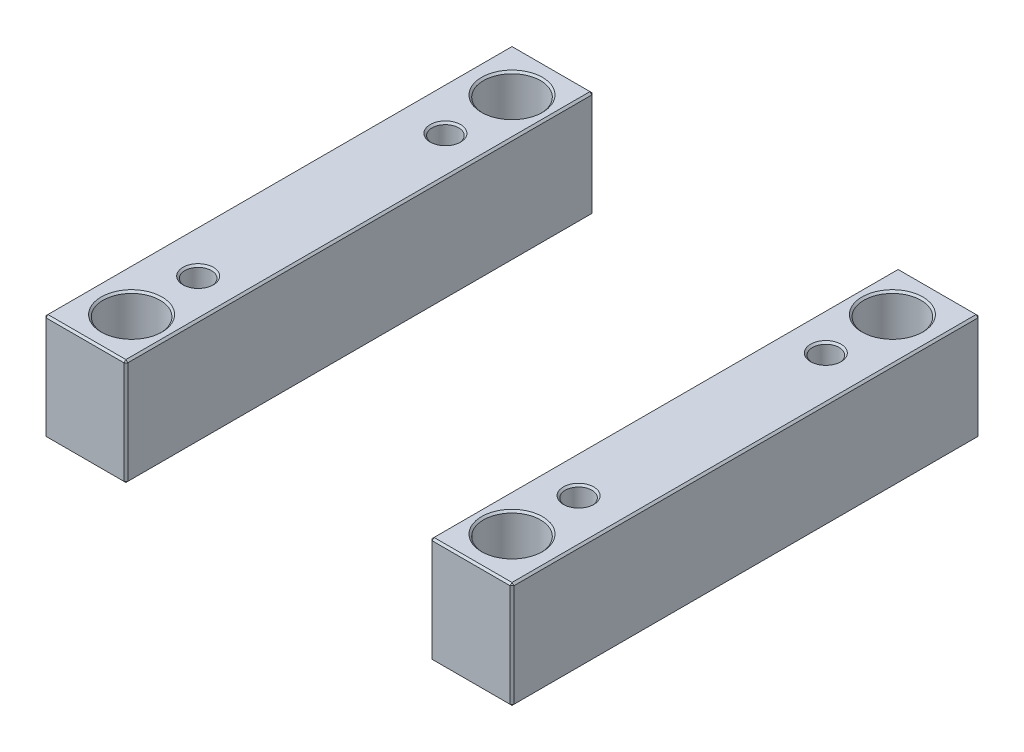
ISO-10303-21;
HEADER;
FILE_DESCRIPTION(('STEP AP214'),'2;1');
FILE_NAME('part.step','',(''),(''),'','','');
FILE_SCHEMA(('AUTOMOTIVE_DESIGN { 1 0 10303 214 1 1 1 1 }'));
ENDSEC;
DATA;
#1=APPLICATION_CONTEXT('core data for automotive mechanical design processes');
#2=APPLICATION_PROTOCOL_DEFINITION('international standard','automotive_design',2000,#1);
#3=PRODUCT_CONTEXT('',#1,'mechanical');
#4=PRODUCT('Part','Part','',(#3));
#5=PRODUCT_RELATED_PRODUCT_CATEGORY('part','',(#4));
#6=PRODUCT_DEFINITION_FORMATION('','',#4);
#7=PRODUCT_DEFINITION_CONTEXT('part definition',#1,'design');
#8=PRODUCT_DEFINITION('design','',#6,#7);
#9=PRODUCT_DEFINITION_SHAPE('','',#8);
#10=(LENGTH_UNIT() NAMED_UNIT(*) SI_UNIT(.MILLI.,.METRE.));
#11=(NAMED_UNIT(*) PLANE_ANGLE_UNIT() SI_UNIT($,.RADIAN.));
#12=(NAMED_UNIT(*) SI_UNIT($,.STERADIAN.) SOLID_ANGLE_UNIT());
#13=UNCERTAINTY_MEASURE_WITH_UNIT(LENGTH_MEASURE(1.E-05),#10,'distance_accuracy_value','');
#14=(GEOMETRIC_REPRESENTATION_CONTEXT(3) GLOBAL_UNCERTAINTY_ASSIGNED_CONTEXT((#13)) GLOBAL_UNIT_ASSIGNED_CONTEXT((#10,
#11,#12)) REPRESENTATION_CONTEXT('',''));
#15=CARTESIAN_POINT('',(0.,0.,0.));
#16=DIRECTION('',(0.,0.,1.));
#17=DIRECTION('',(1.,0.,0.));
#18=AXIS2_PLACEMENT_3D('',#15,#16,#17);
#19=CARTESIAN_POINT('',(-123.,56.,-123.));
#20=DIRECTION('',(0.,0.,1.));
#21=DIRECTION('',(1.,0.,0.));
#22=AXIS2_PLACEMENT_3D('',#19,#20,#21);
#23=PLANE('',#22);
#24=DIRECTION('',(-1.,0.,0.));
#25=VECTOR('',#24,1.);
#26=CARTESIAN_POINT('',(-123.,1.00000000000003,-123.));
#27=LINE('',#26,#25);
#28=CARTESIAN_POINT('',(-81.,1.00000000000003,-123.));
#29=VERTEX_POINT('',#28);
#30=CARTESIAN_POINT('',(-122.,1.00000000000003,-123.));
#31=VERTEX_POINT('',#30);
#32=EDGE_CURVE('P0_E137',#29,#31,#27,.T.);
#33=ORIENTED_EDGE('',*,*,#32,.T.);
#34=DIRECTION('',(0.,1.,0.));
#35=VECTOR('',#34,1.);
#36=CARTESIAN_POINT('',(-122.,56.,-123.));
#37=LINE('',#36,#35);
#38=CARTESIAN_POINT('',(-122.,55.,-123.));
#39=VERTEX_POINT('',#38);
#40=EDGE_CURVE('P0_E265',#31,#39,#37,.T.);
#41=ORIENTED_EDGE('',*,*,#40,.T.);
#42=DIRECTION('',(1.,0.,0.));
#43=VECTOR('',#42,1.);
#44=CARTESIAN_POINT('',(-123.,55.,-123.));
#45=LINE('',#44,#43);
#46=CARTESIAN_POINT('',(-81.,55.,-123.));
#47=VERTEX_POINT('',#46);
#48=EDGE_CURVE('P0_E263',#39,#47,#45,.T.);
#49=ORIENTED_EDGE('',*,*,#48,.T.);
#50=DIRECTION('',(0.,-1.,0.));
#51=VECTOR('',#50,1.);
#52=CARTESIAN_POINT('',(-81.,56.,-123.));
#53=LINE('',#52,#51);
#54=EDGE_CURVE('P0_E260',#47,#29,#53,.T.);
#55=ORIENTED_EDGE('',*,*,#54,.T.);
#56=EDGE_LOOP('',(#33,#41,#49,#55));
#57=FACE_BOUND('',#56,.T.);
#58=ADVANCED_FACE('P0_F16',(#57),#23,.F.);
#59=CARTESIAN_POINT('',(-123.,56.,123.));
#60=DIRECTION('',(1.,0.,0.));
#61=DIRECTION('',(0.,0.,-1.));
#62=AXIS2_PLACEMENT_3D('',#59,#60,#61);
#63=PLANE('',#62);
#64=DIRECTION('',(0.,1.,0.));
#65=VECTOR('',#64,1.);
#66=CARTESIAN_POINT('',(-123.,56.,122.));
#67=LINE('',#66,#65);
#68=CARTESIAN_POINT('',(-123.,1.00000000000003,122.));
#69=VERTEX_POINT('',#68);
#70=CARTESIAN_POINT('',(-123.,55.,122.));
#71=VERTEX_POINT('',#70);
#72=EDGE_CURVE('P0_E253',#69,#71,#67,.T.);
#73=ORIENTED_EDGE('',*,*,#72,.T.);
#74=DIRECTION('',(0.,0.,-1.));
#75=VECTOR('',#74,1.);
#76=CARTESIAN_POINT('',(-123.,55.,123.));
#77=LINE('',#76,#75);
#78=CARTESIAN_POINT('',(-123.,55.,-122.));
#79=VERTEX_POINT('',#78);
#80=EDGE_CURVE('P0_E258',#71,#79,#77,.T.);
#81=ORIENTED_EDGE('',*,*,#80,.T.);
#82=DIRECTION('',(0.,-1.,0.));
#83=VECTOR('',#82,1.);
#84=CARTESIAN_POINT('',(-123.,56.,-122.));
#85=LINE('',#84,#83);
#86=CARTESIAN_POINT('',(-123.,1.00000000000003,-122.));
#87=VERTEX_POINT('',#86);
#88=EDGE_CURVE('P0_E255',#79,#87,#85,.T.);
#89=ORIENTED_EDGE('',*,*,#88,.T.);
#90=DIRECTION('',(0.,0.,1.));
#91=VECTOR('',#90,1.);
#92=CARTESIAN_POINT('',(-123.,1.00000000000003,123.));
#93=LINE('',#92,#91);
#94=EDGE_CURVE('P0_E251',#87,#69,#93,.T.);
#95=ORIENTED_EDGE('',*,*,#94,.T.);
#96=EDGE_LOOP('',(#73,#81,#89,#95));
#97=FACE_BOUND('',#96,.T.);
#98=ADVANCED_FACE('P0_F333',(#97),#63,.F.);
#99=CARTESIAN_POINT('',(-123.,56.,123.));
#100=DIRECTION('',(0.,0.,-1.));
#101=DIRECTION('',(-1.,0.,0.));
#102=AXIS2_PLACEMENT_3D('',#99,#100,#101);
#103=PLANE('',#102);
#104=DIRECTION('',(-1.,0.,0.));
#105=VECTOR('',#104,1.);
#106=CARTESIAN_POINT('',(-123.,55.,123.));
#107=LINE('',#106,#105);
#108=CARTESIAN_POINT('',(-81.,55.,123.));
#109=VERTEX_POINT('',#108);
#110=CARTESIAN_POINT('',(-122.,55.,123.));
#111=VERTEX_POINT('',#110);
#112=EDGE_CURVE('P0_E272',#109,#111,#107,.T.);
#113=ORIENTED_EDGE('',*,*,#112,.T.);
#114=DIRECTION('',(0.,-1.,0.));
#115=VECTOR('',#114,1.);
#116=CARTESIAN_POINT('',(-122.,56.,123.));
#117=LINE('',#116,#115);
#118=CARTESIAN_POINT('',(-122.,1.00000000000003,123.));
#119=VERTEX_POINT('',#118);
#120=EDGE_CURVE('P0_E274',#111,#119,#117,.T.);
#121=ORIENTED_EDGE('',*,*,#120,.T.);
#122=DIRECTION('',(1.,0.,0.));
#123=VECTOR('',#122,1.);
#124=CARTESIAN_POINT('',(-80.,1.00000000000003,123.));
#125=LINE('',#124,#123);
#126=CARTESIAN_POINT('',(-81.,1.00000000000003,123.));
#127=VERTEX_POINT('',#126);
#128=EDGE_CURVE('P0_E270',#119,#127,#125,.T.);
#129=ORIENTED_EDGE('',*,*,#128,.T.);
#130=DIRECTION('',(0.,1.,0.));
#131=VECTOR('',#130,1.);
#132=CARTESIAN_POINT('',(-81.,56.,123.));
#133=LINE('',#132,#131);
#134=EDGE_CURVE('P0_E268',#127,#109,#133,.T.);
#135=ORIENTED_EDGE('',*,*,#134,.T.);
#136=EDGE_LOOP('',(#113,#121,#129,#135));
#137=FACE_BOUND('',#136,.T.);
#138=ADVANCED_FACE('P0_F372',(#137),#103,.F.);
#139=CARTESIAN_POINT('',(-80.,56.,-123.));
#140=DIRECTION('',(-1.,0.,0.));
#141=DIRECTION('',(0.,0.,1.));
#142=AXIS2_PLACEMENT_3D('',#139,#140,#141);
#143=PLANE('',#142);
#144=DIRECTION('',(0.,0.,1.));
#145=VECTOR('',#144,1.);
#146=CARTESIAN_POINT('',(-80.,55.,-123.));
#147=LINE('',#146,#145);
#148=CARTESIAN_POINT('',(-80.,55.,-122.));
#149=VERTEX_POINT('',#148);
#150=CARTESIAN_POINT('',(-80.,55.,122.));
#151=VERTEX_POINT('',#150);
#152=EDGE_CURVE('P0_E31',#149,#151,#147,.T.);
#153=ORIENTED_EDGE('',*,*,#152,.T.);
#154=DIRECTION('',(0.,-1.,0.));
#155=VECTOR('',#154,1.);
#156=CARTESIAN_POINT('',(-80.,56.,122.));
#157=LINE('',#156,#155);
#158=CARTESIAN_POINT('',(-80.,1.00000000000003,122.));
#159=VERTEX_POINT('',#158);
#160=EDGE_CURVE('P0_E190',#151,#159,#157,.T.);
#161=ORIENTED_EDGE('',*,*,#160,.T.);
#162=DIRECTION('',(0.,0.,-1.));
#163=VECTOR('',#162,1.);
#164=CARTESIAN_POINT('',(-80.,1.00000000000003,-123.));
#165=LINE('',#164,#163);
#166=CARTESIAN_POINT('',(-80.,1.00000000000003,-122.));
#167=VERTEX_POINT('',#166);
#168=EDGE_CURVE('P0_E286',#159,#167,#165,.T.);
#169=ORIENTED_EDGE('',*,*,#168,.T.);
#170=DIRECTION('',(0.,1.,0.));
#171=VECTOR('',#170,1.);
#172=CARTESIAN_POINT('',(-80.,56.,-122.));
#173=LINE('',#172,#171);
#174=EDGE_CURVE('P0_E36',#167,#149,#173,.T.);
#175=ORIENTED_EDGE('',*,*,#174,.T.);
#176=EDGE_LOOP('',(#153,#161,#169,#175));
#177=FACE_BOUND('',#176,.T.);
#178=ADVANCED_FACE('P0_F649',(#177),#143,.F.);
#179=CARTESIAN_POINT('',(0.,56.,0.));
#180=DIRECTION('',(0.,-1.,0.));
#181=DIRECTION('',(0.,0.,-1.));
#182=AXIS2_PLACEMENT_3D('',#179,#180,#181);
#183=PLANE('',#182);
#184=CARTESIAN_POINT('',(-100.,56.,-100.));
#185=DIRECTION('',(0.,-1.,0.));
#186=DIRECTION('',(0.,0.,-1.));
#187=AXIS2_PLACEMENT_3D('',#184,#185,#186);
#188=CIRCLE('',#187,16.);
#189=CARTESIAN_POINT('',(-100.,56.,-116.));
#190=VERTEX_POINT('',#189);
#191=EDGE_CURVE('P0_E214',#190,#190,#188,.T.);
#192=ORIENTED_EDGE('',*,*,#191,.T.);
#193=EDGE_LOOP('',(#192));
#194=FACE_BOUND('',#193,.T.);
#195=CARTESIAN_POINT('',(-100.,56.,100.));
#196=DIRECTION('',(0.,-1.,0.));
#197=DIRECTION('',(0.,0.,-1.));
#198=AXIS2_PLACEMENT_3D('',#195,#196,#197);
#199=CIRCLE('',#198,16.);
#200=CARTESIAN_POINT('',(-100.,56.,84.));
#201=VERTEX_POINT('',#200);
#202=EDGE_CURVE('P0_E211',#201,#201,#199,.T.);
#203=ORIENTED_EDGE('',*,*,#202,.T.);
#204=EDGE_LOOP('',(#203));
#205=FACE_BOUND('',#204,.T.);
#206=CARTESIAN_POINT('',(-100.,56.,65.));
#207=DIRECTION('',(0.,-1.,0.));
#208=DIRECTION('',(0.,0.,-1.));
#209=AXIS2_PLACEMENT_3D('',#206,#207,#208);
#210=CIRCLE('',#209,8.);
#211=CARTESIAN_POINT('',(-100.,56.,57.));
#212=VERTEX_POINT('',#211);
#213=EDGE_CURVE('P0_E193',#212,#212,#210,.T.);
#214=ORIENTED_EDGE('',*,*,#213,.T.);
#215=EDGE_LOOP('',(#214));
#216=FACE_BOUND('',#215,.T.);
#217=CARTESIAN_POINT('',(-100.,56.,-65.));
#218=DIRECTION('',(0.,-1.,0.));
#219=DIRECTION('',(0.,0.,-1.));
#220=AXIS2_PLACEMENT_3D('',#217,#218,#219);
#221=CIRCLE('',#220,8.);
#222=CARTESIAN_POINT('',(-100.,56.,-73.));
#223=VERTEX_POINT('',#222);
#224=EDGE_CURVE('P0_E189',#223,#223,#221,.T.);
#225=ORIENTED_EDGE('',*,*,#224,.T.);
#226=EDGE_LOOP('',(#225));
#227=FACE_BOUND('',#226,.T.);
#228=DIRECTION('',(0.,0.,1.));
#229=VECTOR('',#228,1.);
#230=CARTESIAN_POINT('',(-122.,56.,0.));
#231=LINE('',#230,#229);
#232=CARTESIAN_POINT('',(-122.,56.,-122.));
#233=VERTEX_POINT('',#232);
#234=CARTESIAN_POINT('',(-122.,56.,122.));
#235=VERTEX_POINT('',#234);
#236=EDGE_CURVE('P0_E281',#233,#235,#231,.T.);
#237=ORIENTED_EDGE('',*,*,#236,.T.);
#238=DIRECTION('',(1.,0.,0.));
#239=VECTOR('',#238,1.);
#240=CARTESIAN_POINT('',(0.,56.,122.));
#241=LINE('',#240,#239);
#242=CARTESIAN_POINT('',(-81.,56.,122.));
#243=VERTEX_POINT('',#242);
#244=EDGE_CURVE('P0_E283',#235,#243,#241,.T.);
#245=ORIENTED_EDGE('',*,*,#244,.T.);
#246=DIRECTION('',(0.,0.,-1.));
#247=VECTOR('',#246,1.);
#248=CARTESIAN_POINT('',(-81.,56.,0.));
#249=LINE('',#248,#247);
#250=CARTESIAN_POINT('',(-81.,56.,-122.));
#251=VERTEX_POINT('',#250);
#252=EDGE_CURVE('P0_E277',#243,#251,#249,.T.);
#253=ORIENTED_EDGE('',*,*,#252,.T.);
#254=DIRECTION('',(-1.,0.,0.));
#255=VECTOR('',#254,1.);
#256=CARTESIAN_POINT('',(0.,56.,-122.));
#257=LINE('',#256,#255);
#258=EDGE_CURVE('P0_E279',#251,#233,#257,.T.);
#259=ORIENTED_EDGE('',*,*,#258,.T.);
#260=EDGE_LOOP('',(#237,#245,#253,#259));
#261=FACE_BOUND('',#260,.T.);
#262=ADVANCED_FACE('P0_F229',(#194,#205,#216,#227,#261),#183,.F.);
#263=CARTESIAN_POINT('',(0.,0.,0.));
#264=DIRECTION('',(0.,-1.,0.));
#265=DIRECTION('',(0.,0.,-1.));
#266=AXIS2_PLACEMENT_3D('',#263,#264,#265);
#267=PLANE('',#266);
#268=CARTESIAN_POINT('',(-100.,0.,-100.));
#269=DIRECTION('',(0.,-1.,0.));
#270=DIRECTION('',(0.,0.,-1.));
#271=AXIS2_PLACEMENT_3D('',#268,#269,#270);
#272=CIRCLE('',#271,16.);
#273=CARTESIAN_POINT('',(-100.,0.,-116.));
#274=VERTEX_POINT('',#273);
#275=EDGE_CURVE('P0_E202',#274,#274,#272,.F.);
#276=ORIENTED_EDGE('',*,*,#275,.T.);
#277=EDGE_LOOP('',(#276));
#278=FACE_BOUND('',#277,.T.);
#279=CARTESIAN_POINT('',(-100.,0.,100.));
#280=DIRECTION('',(0.,-1.,0.));
#281=DIRECTION('',(0.,0.,-1.));
#282=AXIS2_PLACEMENT_3D('',#279,#280,#281);
#283=CIRCLE('',#282,16.);
#284=CARTESIAN_POINT('',(-100.,0.,84.));
#285=VERTEX_POINT('',#284);
#286=EDGE_CURVE('P0_E199',#285,#285,#283,.F.);
#287=ORIENTED_EDGE('',*,*,#286,.T.);
#288=EDGE_LOOP('',(#287));
#289=FACE_BOUND('',#288,.T.);
#290=CARTESIAN_POINT('',(-100.,0.,-65.));
#291=DIRECTION('',(0.,-1.,0.));
#292=DIRECTION('',(0.,0.,-1.));
#293=AXIS2_PLACEMENT_3D('',#290,#291,#292);
#294=CIRCLE('',#293,8.);
#295=CARTESIAN_POINT('',(-100.,0.,-73.));
#296=VERTEX_POINT('',#295);
#297=EDGE_CURVE('P0_E235',#296,#296,#294,.F.);
#298=ORIENTED_EDGE('',*,*,#297,.T.);
#299=EDGE_LOOP('',(#298));
#300=FACE_BOUND('',#299,.T.);
#301=CARTESIAN_POINT('',(-100.,0.,65.));
#302=DIRECTION('',(0.,-1.,0.));
#303=DIRECTION('',(0.,0.,-1.));
#304=AXIS2_PLACEMENT_3D('',#301,#302,#303);
#305=CIRCLE('',#304,8.);
#306=CARTESIAN_POINT('',(-100.,0.,57.));
#307=VERTEX_POINT('',#306);
#308=EDGE_CURVE('P0_E238',#307,#307,#305,.F.);
#309=ORIENTED_EDGE('',*,*,#308,.T.);
#310=EDGE_LOOP('',(#309));
#311=FACE_BOUND('',#310,.T.);
#312=DIRECTION('',(-1.,0.,0.));
#313=VECTOR('',#312,1.);
#314=CARTESIAN_POINT('',(-123.,0.,122.));
#315=LINE('',#314,#313);
#316=CARTESIAN_POINT('',(-81.,0.,122.));
#317=VERTEX_POINT('',#316);
#318=CARTESIAN_POINT('',(-122.,0.,122.));
#319=VERTEX_POINT('',#318);
#320=EDGE_CURVE('P0_E114',#317,#319,#315,.T.);
#321=ORIENTED_EDGE('',*,*,#320,.T.);
#322=DIRECTION('',(0.,0.,-1.));
#323=VECTOR('',#322,1.);
#324=CARTESIAN_POINT('',(-122.,0.,-123.));
#325=LINE('',#324,#323);
#326=CARTESIAN_POINT('',(-122.,0.,-122.));
#327=VERTEX_POINT('',#326);
#328=EDGE_CURVE('P0_E110',#319,#327,#325,.T.);
#329=ORIENTED_EDGE('',*,*,#328,.T.);
#330=DIRECTION('',(1.,0.,0.));
#331=VECTOR('',#330,1.);
#332=CARTESIAN_POINT('',(-80.,0.,-122.));
#333=LINE('',#332,#331);
#334=CARTESIAN_POINT('',(-81.,0.,-122.));
#335=VERTEX_POINT('',#334);
#336=EDGE_CURVE('P0_E104',#327,#335,#333,.T.);
#337=ORIENTED_EDGE('',*,*,#336,.T.);
#338=DIRECTION('',(0.,0.,1.));
#339=VECTOR('',#338,1.);
#340=CARTESIAN_POINT('',(-81.,0.,123.));
#341=LINE('',#340,#339);
#342=EDGE_CURVE('P0_E107',#335,#317,#341,.T.);
#343=ORIENTED_EDGE('',*,*,#342,.T.);
#344=EDGE_LOOP('',(#321,#329,#337,#343));
#345=FACE_BOUND('',#344,.T.);
#346=ADVANCED_FACE('P0_F106',(#278,#289,#300,#311,#345),#267,.T.);
#347=CARTESIAN_POINT('',(-100.,0.,-65.));
#348=DIRECTION('',(0.,1.,0.));
#349=DIRECTION('',(0.,0.,1.));
#350=AXIS2_PLACEMENT_3D('',#347,#348,#349);
#351=CYLINDRICAL_SURFACE('',#350,7.);
#352=CARTESIAN_POINT('',(-100.,55.,-65.));
#353=DIRECTION('',(0.,-1.,0.));
#354=DIRECTION('',(0.,0.,-1.));
#355=AXIS2_PLACEMENT_3D('',#352,#353,#354);
#356=CIRCLE('',#355,7.);
#357=CARTESIAN_POINT('',(-100.,55.,-72.));
#358=VERTEX_POINT('',#357);
#359=EDGE_CURVE('P0_E196',#358,#358,#356,.F.);
#360=ORIENTED_EDGE('',*,*,#359,.T.);
#361=EDGE_LOOP('',(#360));
#362=FACE_BOUND('',#361,.T.);
#363=CARTESIAN_POINT('',(-100.,1.,-65.));
#364=DIRECTION('',(0.,-1.,0.));
#365=DIRECTION('',(0.,0.,-1.));
#366=AXIS2_PLACEMENT_3D('',#363,#364,#365);
#367=CIRCLE('',#366,7.);
#368=CARTESIAN_POINT('',(-100.,1.,-72.));
#369=VERTEX_POINT('',#368);
#370=EDGE_CURVE('P0_E241',#369,#369,#367,.T.);
#371=ORIENTED_EDGE('',*,*,#370,.T.);
#372=EDGE_LOOP('',(#371));
#373=FACE_BOUND('',#372,.T.);
#374=ADVANCED_FACE('P0_F228',(#362,#373),#351,.F.);
#375=CARTESIAN_POINT('',(-100.,0.,65.));
#376=DIRECTION('',(0.,1.,0.));
#377=DIRECTION('',(0.,0.,1.));
#378=AXIS2_PLACEMENT_3D('',#375,#376,#377);
#379=CYLINDRICAL_SURFACE('',#378,7.);
#380=CARTESIAN_POINT('',(-100.,55.,65.));
#381=DIRECTION('',(0.,-1.,0.));
#382=DIRECTION('',(0.,0.,-1.));
#383=AXIS2_PLACEMENT_3D('',#380,#381,#382);
#384=CIRCLE('',#383,7.);
#385=CARTESIAN_POINT('',(-100.,55.,58.));
#386=VERTEX_POINT('',#385);
#387=EDGE_CURVE('P0_E186',#386,#386,#384,.F.);
#388=ORIENTED_EDGE('',*,*,#387,.T.);
#389=EDGE_LOOP('',(#388));
#390=FACE_BOUND('',#389,.T.);
#391=CARTESIAN_POINT('',(-100.,0.999999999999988,65.));
#392=DIRECTION('',(0.,-1.,0.));
#393=DIRECTION('',(0.,0.,-1.));
#394=AXIS2_PLACEMENT_3D('',#391,#392,#393);
#395=CIRCLE('',#394,7.);
#396=CARTESIAN_POINT('',(-100.,0.999999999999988,58.));
#397=VERTEX_POINT('',#396);
#398=EDGE_CURVE('P0_E248',#397,#397,#395,.T.);
#399=ORIENTED_EDGE('',*,*,#398,.T.);
#400=EDGE_LOOP('',(#399));
#401=FACE_BOUND('',#400,.T.);
#402=ADVANCED_FACE('P0_F380',(#390,#401),#379,.F.);
#403=CARTESIAN_POINT('',(-100.,0.,-65.));
#404=DIRECTION('',(0.,-1.,0.));
#405=DIRECTION('',(0.,0.,-1.));
#406=AXIS2_PLACEMENT_3D('',#403,#404,#405);
#407=CONICAL_SURFACE('',#406,8.,0.78539816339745);
#408=ORIENTED_EDGE('',*,*,#370,.F.);
#409=EDGE_LOOP('',(#408));
#410=FACE_BOUND('',#409,.T.);
#411=ORIENTED_EDGE('',*,*,#297,.F.);
#412=EDGE_LOOP('',(#411));
#413=FACE_BOUND('',#412,.T.);
#414=ADVANCED_FACE('P0_F376',(#410,#413),#407,.F.);
#415=CARTESIAN_POINT('',(-100.,0.,65.));
#416=DIRECTION('',(0.,-1.,0.));
#417=DIRECTION('',(0.,0.,-1.));
#418=AXIS2_PLACEMENT_3D('',#415,#416,#417);
#419=CONICAL_SURFACE('',#418,8.,0.785398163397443);
#420=ORIENTED_EDGE('',*,*,#398,.F.);
#421=EDGE_LOOP('',(#420));
#422=FACE_BOUND('',#421,.T.);
#423=ORIENTED_EDGE('',*,*,#308,.F.);
#424=EDGE_LOOP('',(#423));
#425=FACE_BOUND('',#424,.T.);
#426=ADVANCED_FACE('P0_F379',(#422,#425),#419,.F.);
#427=CARTESIAN_POINT('',(-80.,56.,122.));
#428=DIRECTION('',(-0.707106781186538,0.,-0.707106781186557));
#429=DIRECTION('',(0.,-1.,0.));
#430=AXIS2_PLACEMENT_3D('',#427,#428,#429);
#431=PLANE('',#430);
#432=DIRECTION('',(-0.707106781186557,0.,0.707106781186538));
#433=VECTOR('',#432,1.);
#434=CARTESIAN_POINT('',(-80.5,55.,122.5));
#435=LINE('',#434,#433);
#436=EDGE_CURVE('P0_E125',#109,#151,#435,.F.);
#437=ORIENTED_EDGE('',*,*,#436,.F.);
#438=ORIENTED_EDGE('',*,*,#134,.F.);
#439=DIRECTION('',(0.707106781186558,0.,-0.707106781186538));
#440=VECTOR('',#439,1.);
#441=CARTESIAN_POINT('',(-81.,1.00000000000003,123.));
#442=LINE('',#441,#440);
#443=EDGE_CURVE('P0_E181',#159,#127,#442,.F.);
#444=ORIENTED_EDGE('',*,*,#443,.F.);
#445=ORIENTED_EDGE('',*,*,#160,.F.);
#446=EDGE_LOOP('',(#437,#438,#444,#445));
#447=FACE_BOUND('',#446,.T.);
#448=ADVANCED_FACE('P0_F384',(#447),#431,.F.);
#449=CARTESIAN_POINT('',(-81.,56.,122.));
#450=DIRECTION('',(0.57735026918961,0.577350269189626,0.577350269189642));
#451=DIRECTION('',(0.,-0.707106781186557,0.707106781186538));
#452=AXIS2_PLACEMENT_3D('',#449,#450,#451);
#453=PLANE('',#452);
#454=DIRECTION('',(0.,0.707106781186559,-0.707106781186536));
#455=VECTOR('',#454,1.);
#456=CARTESIAN_POINT('',(-81.,56.,122.));
#457=LINE('',#456,#455);
#458=EDGE_CURVE('P0_E175',#109,#243,#457,.T.);
#459=ORIENTED_EDGE('',*,*,#458,.F.);
#460=ORIENTED_EDGE('',*,*,#436,.T.);
#461=DIRECTION('',(0.707106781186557,-0.707106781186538,0.));
#462=VECTOR('',#461,1.);
#463=CARTESIAN_POINT('',(-81.,56.,122.));
#464=LINE('',#463,#462);
#465=EDGE_CURVE('P0_E178',#243,#151,#464,.T.);
#466=ORIENTED_EDGE('',*,*,#465,.F.);
#467=EDGE_LOOP('',(#459,#460,#466));
#468=FACE_BOUND('',#467,.T.);
#469=ADVANCED_FACE('P0_F588',(#468),#453,.T.);
#470=CARTESIAN_POINT('',(-81.,1.00000000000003,123.));
#471=DIRECTION('',(0.57735026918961,-0.577350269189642,0.577350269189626));
#472=DIRECTION('',(0.,-0.707106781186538,-0.707106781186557));
#473=AXIS2_PLACEMENT_3D('',#470,#471,#472);
#474=PLANE('',#473);
#475=DIRECTION('',(0.707106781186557,0.707106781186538,0.));
#476=VECTOR('',#475,1.);
#477=CARTESIAN_POINT('',(-80.5,0.500000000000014,122.));
#478=LINE('',#477,#476);
#479=EDGE_CURVE('P0_E123',#159,#317,#478,.F.);
#480=ORIENTED_EDGE('',*,*,#479,.F.);
#481=ORIENTED_EDGE('',*,*,#443,.T.);
#482=DIRECTION('',(0.,-0.707106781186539,-0.707106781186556));
#483=VECTOR('',#482,1.);
#484=CARTESIAN_POINT('',(-81.,1.00000000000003,123.));
#485=LINE('',#484,#483);
#486=EDGE_CURVE('P0_E172',#317,#127,#485,.F.);
#487=ORIENTED_EDGE('',*,*,#486,.F.);
#488=EDGE_LOOP('',(#480,#481,#487));
#489=FACE_BOUND('',#488,.T.);
#490=ADVANCED_FACE('P0_F597',(#489),#474,.T.);
#491=CARTESIAN_POINT('',(-81.,56.,0.));
#492=DIRECTION('',(-0.707106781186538,-0.707106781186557,0.));
#493=DIRECTION('',(0.,0.,-1.));
#494=AXIS2_PLACEMENT_3D('',#491,#492,#493);
#495=PLANE('',#494);
#496=ORIENTED_EDGE('',*,*,#465,.T.);
#497=ORIENTED_EDGE('',*,*,#152,.F.);
#498=DIRECTION('',(-0.707106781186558,0.707106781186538,0.));
#499=VECTOR('',#498,1.);
#500=CARTESIAN_POINT('',(-80.5,55.5,-122.));
#501=LINE('',#500,#499);
#502=EDGE_CURVE('P0_E165',#251,#149,#501,.F.);
#503=ORIENTED_EDGE('',*,*,#502,.F.);
#504=ORIENTED_EDGE('',*,*,#252,.F.);
#505=EDGE_LOOP('',(#496,#497,#503,#504));
#506=FACE_BOUND('',#505,.T.);
#507=ADVANCED_FACE('P0_F349',(#506),#495,.F.);
#508=CARTESIAN_POINT('',(0.,56.,122.));
#509=DIRECTION('',(0.,-0.707106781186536,-0.707106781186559));
#510=DIRECTION('',(1.,0.,0.));
#511=AXIS2_PLACEMENT_3D('',#508,#509,#510);
#512=PLANE('',#511);
#513=ORIENTED_EDGE('',*,*,#458,.T.);
#514=ORIENTED_EDGE('',*,*,#244,.F.);
#515=DIRECTION('',(0.,-0.707106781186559,0.707106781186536));
#516=VECTOR('',#515,1.);
#517=CARTESIAN_POINT('',(-122.,55.5,122.5));
#518=LINE('',#517,#516);
#519=EDGE_CURVE('P0_E162',#111,#235,#518,.F.);
#520=ORIENTED_EDGE('',*,*,#519,.F.);
#521=ORIENTED_EDGE('',*,*,#112,.F.);
#522=EDGE_LOOP('',(#513,#514,#520,#521));
#523=FACE_BOUND('',#522,.T.);
#524=ADVANCED_FACE('P0_F344',(#523),#512,.F.);
#525=CARTESIAN_POINT('',(-122.,56.,123.));
#526=DIRECTION('',(0.707106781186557,0.,-0.707106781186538));
#527=DIRECTION('',(0.,-1.,0.));
#528=AXIS2_PLACEMENT_3D('',#525,#526,#527);
#529=PLANE('',#528);
#530=DIRECTION('',(0.707106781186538,0.,0.707106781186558));
#531=VECTOR('',#530,1.);
#532=CARTESIAN_POINT('',(-122.,1.00000000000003,123.));
#533=LINE('',#532,#531);
#534=EDGE_CURVE('P0_E156',#119,#69,#533,.F.);
#535=ORIENTED_EDGE('',*,*,#534,.F.);
#536=ORIENTED_EDGE('',*,*,#120,.F.);
#537=DIRECTION('',(-0.707106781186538,0.,-0.707106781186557));
#538=VECTOR('',#537,1.);
#539=CARTESIAN_POINT('',(-123.,55.,122.));
#540=LINE('',#539,#538);
#541=EDGE_CURVE('P0_E159',#71,#111,#540,.F.);
#542=ORIENTED_EDGE('',*,*,#541,.F.);
#543=ORIENTED_EDGE('',*,*,#72,.F.);
#544=EDGE_LOOP('',(#535,#536,#542,#543));
#545=FACE_BOUND('',#544,.T.);
#546=ADVANCED_FACE('P0_F338',(#545),#529,.F.);
#547=CARTESIAN_POINT('',(-123.,1.00000000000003,123.));
#548=DIRECTION('',(0.,-0.707106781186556,0.707106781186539));
#549=DIRECTION('',(-1.,0.,0.));
#550=AXIS2_PLACEMENT_3D('',#547,#548,#549);
#551=PLANE('',#550);
#552=ORIENTED_EDGE('',*,*,#486,.T.);
#553=ORIENTED_EDGE('',*,*,#128,.F.);
#554=DIRECTION('',(0.,0.707106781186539,0.707106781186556));
#555=VECTOR('',#554,1.);
#556=CARTESIAN_POINT('',(-122.,1.00000000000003,123.));
#557=LINE('',#556,#555);
#558=EDGE_CURVE('P0_E134',#319,#119,#557,.T.);
#559=ORIENTED_EDGE('',*,*,#558,.F.);
#560=ORIENTED_EDGE('',*,*,#320,.F.);
#561=EDGE_LOOP('',(#552,#553,#559,#560));
#562=FACE_BOUND('',#561,.T.);
#563=ADVANCED_FACE('P0_F364',(#562),#551,.T.);
#564=CARTESIAN_POINT('',(-80.,1.00000000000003,-123.));
#565=DIRECTION('',(0.707106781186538,-0.707106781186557,0.));
#566=DIRECTION('',(0.,0.,1.));
#567=AXIS2_PLACEMENT_3D('',#564,#565,#566);
#568=PLANE('',#567);
#569=ORIENTED_EDGE('',*,*,#479,.T.);
#570=ORIENTED_EDGE('',*,*,#342,.F.);
#571=DIRECTION('',(-0.707106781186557,-0.707106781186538,0.));
#572=VECTOR('',#571,1.);
#573=CARTESIAN_POINT('',(-81.,0.,-122.));
#574=LINE('',#573,#572);
#575=EDGE_CURVE('P0_E120',#167,#335,#574,.T.);
#576=ORIENTED_EDGE('',*,*,#575,.F.);
#577=ORIENTED_EDGE('',*,*,#168,.F.);
#578=EDGE_LOOP('',(#569,#570,#576,#577));
#579=FACE_BOUND('',#578,.T.);
#580=ADVANCED_FACE('P0_F119',(#579),#568,.T.);
#581=CARTESIAN_POINT('',(-81.,56.,-123.));
#582=DIRECTION('',(-0.707106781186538,0.,0.707106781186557));
#583=DIRECTION('',(0.,-1.,0.));
#584=AXIS2_PLACEMENT_3D('',#581,#582,#583);
#585=PLANE('',#584);
#586=DIRECTION('',(0.707106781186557,0.,0.707106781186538));
#587=VECTOR('',#586,1.);
#588=CARTESIAN_POINT('',(-81.,55.,-123.));
#589=LINE('',#588,#587);
#590=EDGE_CURVE('P0_E168',#149,#47,#589,.F.);
#591=ORIENTED_EDGE('',*,*,#590,.F.);
#592=ORIENTED_EDGE('',*,*,#174,.F.);
#593=DIRECTION('',(-0.707106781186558,0.,-0.707106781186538));
#594=VECTOR('',#593,1.);
#595=CARTESIAN_POINT('',(-80.5,1.00000000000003,-122.5));
#596=LINE('',#595,#594);
#597=EDGE_CURVE('P0_E133',#29,#167,#596,.F.);
#598=ORIENTED_EDGE('',*,*,#597,.F.);
#599=ORIENTED_EDGE('',*,*,#54,.F.);
#600=EDGE_LOOP('',(#591,#592,#598,#599));
#601=FACE_BOUND('',#600,.T.);
#602=ADVANCED_FACE('P0_F354',(#601),#585,.F.);
#603=CARTESIAN_POINT('',(-81.,55.,-123.));
#604=DIRECTION('',(0.57735026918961,0.577350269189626,-0.577350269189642));
#605=DIRECTION('',(0.,0.707106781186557,0.707106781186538));
#606=AXIS2_PLACEMENT_3D('',#603,#604,#605);
#607=PLANE('',#606);
#608=ORIENTED_EDGE('',*,*,#502,.T.);
#609=ORIENTED_EDGE('',*,*,#590,.T.);
#610=DIRECTION('',(0.,-0.707106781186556,-0.707106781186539));
#611=VECTOR('',#610,1.);
#612=CARTESIAN_POINT('',(-81.,55.,-123.));
#613=LINE('',#612,#611);
#614=EDGE_CURVE('P0_E151',#251,#47,#613,.T.);
#615=ORIENTED_EDGE('',*,*,#614,.F.);
#616=EDGE_LOOP('',(#608,#609,#615));
#617=FACE_BOUND('',#616,.T.);
#618=ADVANCED_FACE('P0_F352',(#617),#607,.T.);
#619=CARTESIAN_POINT('',(-123.,55.,122.));
#620=DIRECTION('',(-0.577350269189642,0.57735026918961,0.577350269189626));
#621=DIRECTION('',(0.707106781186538,0.,0.707106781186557));
#622=AXIS2_PLACEMENT_3D('',#619,#620,#621);
#623=PLANE('',#622);
#624=ORIENTED_EDGE('',*,*,#541,.T.);
#625=ORIENTED_EDGE('',*,*,#519,.T.);
#626=DIRECTION('',(0.707106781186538,0.707106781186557,0.));
#627=VECTOR('',#626,1.);
#628=CARTESIAN_POINT('',(-123.,55.,122.));
#629=LINE('',#628,#627);
#630=EDGE_CURVE('P0_E142',#71,#235,#629,.T.);
#631=ORIENTED_EDGE('',*,*,#630,.F.);
#632=EDGE_LOOP('',(#624,#625,#631));
#633=FACE_BOUND('',#632,.T.);
#634=ADVANCED_FACE('P0_F341',(#633),#623,.T.);
#635=CARTESIAN_POINT('',(-122.,1.00000000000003,123.));
#636=DIRECTION('',(-0.577350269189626,-0.577350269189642,0.57735026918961));
#637=DIRECTION('',(0.707106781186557,-0.707106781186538,0.));
#638=AXIS2_PLACEMENT_3D('',#635,#636,#637);
#639=PLANE('',#638);
#640=ORIENTED_EDGE('',*,*,#558,.T.);
#641=ORIENTED_EDGE('',*,*,#534,.T.);
#642=DIRECTION('',(0.707106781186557,-0.707106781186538,0.));
#643=VECTOR('',#642,1.);
#644=CARTESIAN_POINT('',(-122.5,0.500000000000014,122.));
#645=LINE('',#644,#643);
#646=EDGE_CURVE('P0_E138',#319,#69,#645,.F.);
#647=ORIENTED_EDGE('',*,*,#646,.F.);
#648=EDGE_LOOP('',(#640,#641,#647));
#649=FACE_BOUND('',#648,.T.);
#650=ADVANCED_FACE('P0_F403',(#649),#639,.T.);
#651=CARTESIAN_POINT('',(-81.,0.,-122.));
#652=DIRECTION('',(0.57735026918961,-0.577350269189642,-0.577350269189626));
#653=DIRECTION('',(0.,0.707106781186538,-0.707106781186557));
#654=AXIS2_PLACEMENT_3D('',#651,#652,#653);
#655=PLANE('',#654);
#656=ORIENTED_EDGE('',*,*,#597,.T.);
#657=ORIENTED_EDGE('',*,*,#575,.T.);
#658=DIRECTION('',(0.,0.707106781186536,-0.707106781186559));
#659=VECTOR('',#658,1.);
#660=CARTESIAN_POINT('',(-81.,0.,-122.));
#661=LINE('',#660,#659);
#662=EDGE_CURVE('P0_E130',#29,#335,#661,.F.);
#663=ORIENTED_EDGE('',*,*,#662,.F.);
#664=EDGE_LOOP('',(#656,#657,#663));
#665=FACE_BOUND('',#664,.T.);
#666=ADVANCED_FACE('P0_F129',(#665),#655,.T.);
#667=CARTESIAN_POINT('',(0.,56.,-122.));
#668=DIRECTION('',(0.,-0.707106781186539,0.707106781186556));
#669=DIRECTION('',(-1.,0.,0.));
#670=AXIS2_PLACEMENT_3D('',#667,#668,#669);
#671=PLANE('',#670);
#672=ORIENTED_EDGE('',*,*,#614,.T.);
#673=ORIENTED_EDGE('',*,*,#48,.F.);
#674=DIRECTION('',(0.,0.707106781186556,0.707106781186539));
#675=VECTOR('',#674,1.);
#676=CARTESIAN_POINT('',(-122.,55.,-123.));
#677=LINE('',#676,#675);
#678=EDGE_CURVE('P0_E139',#233,#39,#677,.F.);
#679=ORIENTED_EDGE('',*,*,#678,.F.);
#680=ORIENTED_EDGE('',*,*,#258,.F.);
#681=EDGE_LOOP('',(#672,#673,#679,#680));
#682=FACE_BOUND('',#681,.T.);
#683=ADVANCED_FACE('P0_F316',(#682),#671,.F.);
#684=CARTESIAN_POINT('',(-122.,56.,0.));
#685=DIRECTION('',(0.707106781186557,-0.707106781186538,0.));
#686=DIRECTION('',(0.,0.,1.));
#687=AXIS2_PLACEMENT_3D('',#684,#685,#686);
#688=PLANE('',#687);
#689=ORIENTED_EDGE('',*,*,#630,.T.);
#690=ORIENTED_EDGE('',*,*,#236,.F.);
#691=DIRECTION('',(-0.707106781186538,-0.707106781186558,0.));
#692=VECTOR('',#691,1.);
#693=CARTESIAN_POINT('',(-122.5,55.5,-122.));
#694=LINE('',#693,#692);
#695=EDGE_CURVE('P0_E145',#79,#233,#694,.F.);
#696=ORIENTED_EDGE('',*,*,#695,.F.);
#697=ORIENTED_EDGE('',*,*,#80,.F.);
#698=EDGE_LOOP('',(#689,#690,#696,#697));
#699=FACE_BOUND('',#698,.T.);
#700=ADVANCED_FACE('P0_F310',(#699),#688,.F.);
#701=CARTESIAN_POINT('',(-123.,1.00000000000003,123.));
#702=DIRECTION('',(-0.707106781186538,-0.707106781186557,0.));
#703=DIRECTION('',(0.,0.,-1.));
#704=AXIS2_PLACEMENT_3D('',#701,#702,#703);
#705=PLANE('',#704);
#706=ORIENTED_EDGE('',*,*,#646,.T.);
#707=ORIENTED_EDGE('',*,*,#94,.F.);
#708=DIRECTION('',(-0.707106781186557,0.707106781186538,0.));
#709=VECTOR('',#708,1.);
#710=CARTESIAN_POINT('',(-123.,1.00000000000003,-122.));
#711=LINE('',#710,#709);
#712=EDGE_CURVE('P0_E297',#327,#87,#711,.T.);
#713=ORIENTED_EDGE('',*,*,#712,.F.);
#714=ORIENTED_EDGE('',*,*,#328,.F.);
#715=EDGE_LOOP('',(#706,#707,#713,#714));
#716=FACE_BOUND('',#715,.T.);
#717=ADVANCED_FACE('P0_F329',(#716),#705,.T.);
#718=CARTESIAN_POINT('',(-123.,1.00000000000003,-123.));
#719=DIRECTION('',(0.,-0.707106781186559,-0.707106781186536));
#720=DIRECTION('',(1.,0.,0.));
#721=AXIS2_PLACEMENT_3D('',#718,#719,#720);
#722=PLANE('',#721);
#723=ORIENTED_EDGE('',*,*,#662,.T.);
#724=ORIENTED_EDGE('',*,*,#336,.F.);
#725=DIRECTION('',(0.,-0.707106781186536,0.707106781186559));
#726=VECTOR('',#725,1.);
#727=CARTESIAN_POINT('',(-122.,0.500000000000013,-122.5));
#728=LINE('',#727,#726);
#729=EDGE_CURVE('P0_E295',#31,#327,#728,.T.);
#730=ORIENTED_EDGE('',*,*,#729,.F.);
#731=ORIENTED_EDGE('',*,*,#32,.F.);
#732=EDGE_LOOP('',(#723,#724,#730,#731));
#733=FACE_BOUND('',#732,.T.);
#734=ADVANCED_FACE('P0_F136',(#733),#722,.T.);
#735=CARTESIAN_POINT('',(-122.,55.,-123.));
#736=DIRECTION('',(-0.577350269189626,0.57735026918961,-0.577350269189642));
#737=DIRECTION('',(-0.707106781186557,0.,0.707106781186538));
#738=AXIS2_PLACEMENT_3D('',#735,#736,#737);
#739=PLANE('',#738);
#740=ORIENTED_EDGE('',*,*,#695,.T.);
#741=ORIENTED_EDGE('',*,*,#678,.T.);
#742=DIRECTION('',(0.707106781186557,0.,-0.707106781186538));
#743=VECTOR('',#742,1.);
#744=CARTESIAN_POINT('',(-122.,55.,-123.));
#745=LINE('',#744,#743);
#746=EDGE_CURVE('P0_E293',#79,#39,#745,.T.);
#747=ORIENTED_EDGE('',*,*,#746,.F.);
#748=EDGE_LOOP('',(#740,#741,#747));
#749=FACE_BOUND('',#748,.T.);
#750=ADVANCED_FACE('P0_F303',(#749),#739,.T.);
#751=CARTESIAN_POINT('',(-123.,1.00000000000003,-122.));
#752=DIRECTION('',(-0.57735026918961,-0.577350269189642,-0.577350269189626));
#753=DIRECTION('',(0.,0.707106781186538,-0.707106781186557));
#754=AXIS2_PLACEMENT_3D('',#751,#752,#753);
#755=PLANE('',#754);
#756=ORIENTED_EDGE('',*,*,#729,.T.);
#757=ORIENTED_EDGE('',*,*,#712,.T.);
#758=DIRECTION('',(-0.707106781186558,0.,0.707106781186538));
#759=VECTOR('',#758,1.);
#760=CARTESIAN_POINT('',(-123.,1.00000000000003,-122.));
#761=LINE('',#760,#759);
#762=EDGE_CURVE('P0_E291',#31,#87,#761,.T.);
#763=ORIENTED_EDGE('',*,*,#762,.F.);
#764=EDGE_LOOP('',(#756,#757,#763));
#765=FACE_BOUND('',#764,.T.);
#766=ADVANCED_FACE('P0_F325',(#765),#755,.T.);
#767=CARTESIAN_POINT('',(-123.,56.,-122.));
#768=DIRECTION('',(0.707106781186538,0.,0.707106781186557));
#769=DIRECTION('',(0.,-1.,0.));
#770=AXIS2_PLACEMENT_3D('',#767,#768,#769);
#771=PLANE('',#770);
#772=ORIENTED_EDGE('',*,*,#746,.T.);
#773=ORIENTED_EDGE('',*,*,#40,.F.);
#774=ORIENTED_EDGE('',*,*,#762,.T.);
#775=ORIENTED_EDGE('',*,*,#88,.F.);
#776=EDGE_LOOP('',(#772,#773,#774,#775));
#777=FACE_BOUND('',#776,.T.);
#778=ADVANCED_FACE('P0_F323',(#777),#771,.F.);
#779=CARTESIAN_POINT('',(-100.,55.,65.));
#780=DIRECTION('',(0.,1.,0.));
#781=DIRECTION('',(0.,0.,1.));
#782=AXIS2_PLACEMENT_3D('',#779,#780,#781);
#783=CONICAL_SURFACE('',#782,7.,0.785398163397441);
#784=ORIENTED_EDGE('',*,*,#213,.F.);
#785=EDGE_LOOP('',(#784));
#786=FACE_BOUND('',#785,.T.);
#787=ORIENTED_EDGE('',*,*,#387,.F.);
#788=EDGE_LOOP('',(#787));
#789=FACE_BOUND('',#788,.T.);
#790=ADVANCED_FACE('P0_F388',(#786,#789),#783,.F.);
#791=CARTESIAN_POINT('',(-100.,55.,-65.));
#792=DIRECTION('',(0.,1.,0.));
#793=DIRECTION('',(0.,0.,1.));
#794=AXIS2_PLACEMENT_3D('',#791,#792,#793);
#795=CONICAL_SURFACE('',#794,7.,0.785398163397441);
#796=ORIENTED_EDGE('',*,*,#224,.F.);
#797=EDGE_LOOP('',(#796));
#798=FACE_BOUND('',#797,.T.);
#799=ORIENTED_EDGE('',*,*,#359,.F.);
#800=EDGE_LOOP('',(#799));
#801=FACE_BOUND('',#800,.T.);
#802=ADVANCED_FACE('P0_F470',(#798,#801),#795,.F.);
#803=CARTESIAN_POINT('',(-100.,0.,100.));
#804=DIRECTION('',(0.,1.,0.));
#805=DIRECTION('',(0.,0.,1.));
#806=AXIS2_PLACEMENT_3D('',#803,#804,#805);
#807=CYLINDRICAL_SURFACE('',#806,15.);
#808=CARTESIAN_POINT('',(-100.,55.,100.));
#809=DIRECTION('',(0.,-1.,0.));
#810=DIRECTION('',(0.,0.,-1.));
#811=AXIS2_PLACEMENT_3D('',#808,#809,#810);
#812=CIRCLE('',#811,15.);
#813=CARTESIAN_POINT('',(-100.,55.,85.));
#814=VERTEX_POINT('',#813);
#815=EDGE_CURVE('P0_E10',#814,#814,#812,.F.);
#816=ORIENTED_EDGE('',*,*,#815,.T.);
#817=EDGE_LOOP('',(#816));
#818=FACE_BOUND('',#817,.T.);
#819=CARTESIAN_POINT('',(-100.,1.00000000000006,100.));
#820=DIRECTION('',(0.,-1.,0.));
#821=DIRECTION('',(0.,0.,-1.));
#822=AXIS2_PLACEMENT_3D('',#819,#820,#821);
#823=CIRCLE('',#822,15.);
#824=CARTESIAN_POINT('',(-100.,1.00000000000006,85.));
#825=VERTEX_POINT('',#824);
#826=EDGE_CURVE('P0_E24',#825,#825,#823,.T.);
#827=ORIENTED_EDGE('',*,*,#826,.T.);
#828=EDGE_LOOP('',(#827));
#829=FACE_BOUND('',#828,.T.);
#830=ADVANCED_FACE('P0_F219',(#818,#829),#807,.F.);
#831=CARTESIAN_POINT('',(-100.,0.,-100.));
#832=DIRECTION('',(0.,1.,0.));
#833=DIRECTION('',(0.,0.,1.));
#834=AXIS2_PLACEMENT_3D('',#831,#832,#833);
#835=CYLINDRICAL_SURFACE('',#834,15.);
#836=CARTESIAN_POINT('',(-100.,1.,-100.));
#837=DIRECTION('',(0.,-1.,0.));
#838=DIRECTION('',(0.,0.,-1.));
#839=AXIS2_PLACEMENT_3D('',#836,#837,#838);
#840=CIRCLE('',#839,15.);
#841=CARTESIAN_POINT('',(-100.,1.,-115.));
#842=VERTEX_POINT('',#841);
#843=EDGE_CURVE('P0_E208',#842,#842,#840,.T.);
#844=ORIENTED_EDGE('',*,*,#843,.T.);
#845=EDGE_LOOP('',(#844));
#846=FACE_BOUND('',#845,.T.);
#847=CARTESIAN_POINT('',(-100.,55.,-100.));
#848=DIRECTION('',(0.,-1.,0.));
#849=DIRECTION('',(0.,0.,-1.));
#850=AXIS2_PLACEMENT_3D('',#847,#848,#849);
#851=CIRCLE('',#850,15.);
#852=CARTESIAN_POINT('',(-100.,55.,-115.));
#853=VERTEX_POINT('',#852);
#854=EDGE_CURVE('P0_E205',#853,#853,#851,.F.);
#855=ORIENTED_EDGE('',*,*,#854,.T.);
#856=EDGE_LOOP('',(#855));
#857=FACE_BOUND('',#856,.T.);
#858=ADVANCED_FACE('P0_F487',(#846,#857),#835,.F.);
#859=CARTESIAN_POINT('',(-100.,0.,-100.));
#860=DIRECTION('',(0.,-1.,0.));
#861=DIRECTION('',(0.,0.,-1.));
#862=AXIS2_PLACEMENT_3D('',#859,#860,#861);
#863=CONICAL_SURFACE('',#862,16.,0.785398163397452);
#864=ORIENTED_EDGE('',*,*,#843,.F.);
#865=EDGE_LOOP('',(#864));
#866=FACE_BOUND('',#865,.T.);
#867=ORIENTED_EDGE('',*,*,#275,.F.);
#868=EDGE_LOOP('',(#867));
#869=FACE_BOUND('',#868,.T.);
#870=ADVANCED_FACE('P0_F496',(#866,#869),#863,.F.);
#871=CARTESIAN_POINT('',(-100.,55.,-100.));
#872=DIRECTION('',(0.,1.,0.));
#873=DIRECTION('',(0.,0.,1.));
#874=AXIS2_PLACEMENT_3D('',#871,#872,#873);
#875=CONICAL_SURFACE('',#874,15.,0.785398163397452);
#876=ORIENTED_EDGE('',*,*,#191,.F.);
#877=EDGE_LOOP('',(#876));
#878=FACE_BOUND('',#877,.T.);
#879=ORIENTED_EDGE('',*,*,#854,.F.);
#880=EDGE_LOOP('',(#879));
#881=FACE_BOUND('',#880,.T.);
#882=ADVANCED_FACE('P0_F505',(#878,#881),#875,.F.);
#883=CARTESIAN_POINT('',(-100.,55.,100.));
#884=DIRECTION('',(0.,1.,0.));
#885=DIRECTION('',(0.,0.,1.));
#886=AXIS2_PLACEMENT_3D('',#883,#884,#885);
#887=CONICAL_SURFACE('',#886,15.,0.785398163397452);
#888=ORIENTED_EDGE('',*,*,#202,.F.);
#889=EDGE_LOOP('',(#888));
#890=FACE_BOUND('',#889,.T.);
#891=ORIENTED_EDGE('',*,*,#815,.F.);
#892=EDGE_LOOP('',(#891));
#893=FACE_BOUND('',#892,.T.);
#894=ADVANCED_FACE('P0_F223',(#890,#893),#887,.F.);
#895=CARTESIAN_POINT('',(-100.,0.,100.));
#896=DIRECTION('',(0.,-1.,0.));
#897=DIRECTION('',(0.,0.,-1.));
#898=AXIS2_PLACEMENT_3D('',#895,#896,#897);
#899=CONICAL_SURFACE('',#898,16.,0.785398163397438);
#900=ORIENTED_EDGE('',*,*,#826,.F.);
#901=EDGE_LOOP('',(#900));
#902=FACE_BOUND('',#901,.T.);
#903=ORIENTED_EDGE('',*,*,#286,.F.);
#904=EDGE_LOOP('',(#903));
#905=FACE_BOUND('',#904,.T.);
#906=ADVANCED_FACE('P0_F18',(#902,#905),#899,.F.);
#907=CLOSED_SHELL('',(#58,#98,#138,#178,#262,#346,#374,#402,#414,#426,#448,#469,#490,#507,#524,
#546,#563,#580,#602,#618,#634,#650,#666,#683,#700,#717,#734,#750,#766,#778,#790,#802,#830,#858,
#870,#882,#894,#906));
#908=MANIFOLD_SOLID_BREP('P0_B1',#907);
#909=CARTESIAN_POINT('',(123.,56.,123.));
#910=DIRECTION('',(0.,0.,-1.));
#911=DIRECTION('',(-1.,0.,0.));
#912=AXIS2_PLACEMENT_3D('',#909,#910,#911);
#913=PLANE('',#912);
#914=DIRECTION('',(0.,-1.,0.));
#915=VECTOR('',#914,1.);
#916=CARTESIAN_POINT('',(81.,56.,123.));
#917=LINE('',#916,#915);
#918=CARTESIAN_POINT('',(81.,55.,123.));
#919=VERTEX_POINT('',#918);
#920=CARTESIAN_POINT('',(81.,1.,123.));
#921=VERTEX_POINT('',#920);
#922=EDGE_CURVE('P1_E174',#919,#921,#917,.T.);
#923=ORIENTED_EDGE('',*,*,#922,.T.);
#924=DIRECTION('',(1.,0.,0.));
#925=VECTOR('',#924,1.);
#926=CARTESIAN_POINT('',(123.,1.,123.));
#927=LINE('',#926,#925);
#928=CARTESIAN_POINT('',(122.,1.,123.));
#929=VERTEX_POINT('',#928);
#930=EDGE_CURVE('P1_E176',#921,#929,#927,.T.);
#931=ORIENTED_EDGE('',*,*,#930,.T.);
#932=DIRECTION('',(0.,1.,0.));
#933=VECTOR('',#932,1.);
#934=CARTESIAN_POINT('',(122.,56.,123.));
#935=LINE('',#934,#933);
#936=CARTESIAN_POINT('',(122.,55.,123.));
#937=VERTEX_POINT('',#936);
#938=EDGE_CURVE('P1_E172',#929,#937,#935,.T.);
#939=ORIENTED_EDGE('',*,*,#938,.T.);
#940=DIRECTION('',(-1.,0.,0.));
#941=VECTOR('',#940,1.);
#942=CARTESIAN_POINT('',(80.,55.,123.));
#943=LINE('',#942,#941);
#944=EDGE_CURVE('P1_E170',#937,#919,#943,.T.);
#945=ORIENTED_EDGE('',*,*,#944,.T.);
#946=EDGE_LOOP('',(#923,#931,#939,#945));
#947=FACE_BOUND('',#946,.T.);
#948=ADVANCED_FACE('P1_F16',(#947),#913,.F.);
#949=CARTESIAN_POINT('',(123.,56.,123.));
#950=DIRECTION('',(-1.,0.,0.));
#951=DIRECTION('',(0.,0.,1.));
#952=AXIS2_PLACEMENT_3D('',#949,#950,#951);
#953=PLANE('',#952);
#954=DIRECTION('',(0.,0.,1.));
#955=VECTOR('',#954,1.);
#956=CARTESIAN_POINT('',(123.,55.,123.));
#957=LINE('',#956,#955);
#958=CARTESIAN_POINT('',(123.,55.,-122.));
#959=VERTEX_POINT('',#958);
#960=CARTESIAN_POINT('',(123.,55.,122.));
#961=VERTEX_POINT('',#960);
#962=EDGE_CURVE('P1_E188',#959,#961,#957,.T.);
#963=ORIENTED_EDGE('',*,*,#962,.T.);
#964=DIRECTION('',(0.,-1.,0.));
#965=VECTOR('',#964,1.);
#966=CARTESIAN_POINT('',(123.,56.,122.));
#967=LINE('',#966,#965);
#968=CARTESIAN_POINT('',(123.,1.,122.));
#969=VERTEX_POINT('',#968);
#970=EDGE_CURVE('P1_E194',#961,#969,#967,.T.);
#971=ORIENTED_EDGE('',*,*,#970,.T.);
#972=DIRECTION('',(0.,0.,-1.));
#973=VECTOR('',#972,1.);
#974=CARTESIAN_POINT('',(123.,1.,123.));
#975=LINE('',#974,#973);
#976=CARTESIAN_POINT('',(123.,1.,-122.));
#977=VERTEX_POINT('',#976);
#978=EDGE_CURVE('P1_E192',#969,#977,#975,.T.);
#979=ORIENTED_EDGE('',*,*,#978,.T.);
#980=DIRECTION('',(0.,1.,0.));
#981=VECTOR('',#980,1.);
#982=CARTESIAN_POINT('',(123.,56.,-122.));
#983=LINE('',#982,#981);
#984=EDGE_CURVE('P1_E190',#977,#959,#983,.T.);
#985=ORIENTED_EDGE('',*,*,#984,.T.);
#986=EDGE_LOOP('',(#963,#971,#979,#985));
#987=FACE_BOUND('',#986,.T.);
#988=ADVANCED_FACE('P1_F321',(#987),#953,.F.);
#989=CARTESIAN_POINT('',(123.,56.,-123.));
#990=DIRECTION('',(0.,0.,1.));
#991=DIRECTION('',(1.,0.,0.));
#992=AXIS2_PLACEMENT_3D('',#989,#990,#991);
#993=PLANE('',#992);
#994=DIRECTION('',(0.,-1.,0.));
#995=VECTOR('',#994,1.);
#996=CARTESIAN_POINT('',(122.,56.,-123.));
#997=LINE('',#996,#995);
#998=CARTESIAN_POINT('',(122.,55.,-123.));
#999=VERTEX_POINT('',#998);
#1000=CARTESIAN_POINT('',(122.,1.,-123.));
#1001=VERTEX_POINT('',#1000);
#1002=EDGE_CURVE('P1_E165',#999,#1001,#997,.T.);
#1003=ORIENTED_EDGE('',*,*,#1002,.T.);
#1004=DIRECTION('',(-1.,0.,0.));
#1005=VECTOR('',#1004,1.);
#1006=CARTESIAN_POINT('',(123.,1.,-123.));
#1007=LINE('',#1006,#1005);
#1008=CARTESIAN_POINT('',(81.,1.,-123.));
#1009=VERTEX_POINT('',#1008);
#1010=EDGE_CURVE('P1_E112',#1001,#1009,#1007,.T.);
#1011=ORIENTED_EDGE('',*,*,#1010,.T.);
#1012=DIRECTION('',(0.,1.,0.));
#1013=VECTOR('',#1012,1.);
#1014=CARTESIAN_POINT('',(81.,56.,-123.));
#1015=LINE('',#1014,#1013);
#1016=CARTESIAN_POINT('',(81.,55.,-123.));
#1017=VERTEX_POINT('',#1016);
#1018=EDGE_CURVE('P1_E167',#1009,#1017,#1015,.T.);
#1019=ORIENTED_EDGE('',*,*,#1018,.T.);
#1020=DIRECTION('',(1.,0.,0.));
#1021=VECTOR('',#1020,1.);
#1022=CARTESIAN_POINT('',(123.,55.,-123.));
#1023=LINE('',#1022,#1021);
#1024=EDGE_CURVE('P1_E163',#1017,#999,#1023,.T.);
#1025=ORIENTED_EDGE('',*,*,#1024,.T.);
#1026=EDGE_LOOP('',(#1003,#1011,#1019,#1025));
#1027=FACE_BOUND('',#1026,.T.);
#1028=ADVANCED_FACE('P1_F328',(#1027),#993,.F.);
#1029=CARTESIAN_POINT('',(80.,56.,-123.));
#1030=DIRECTION('',(1.,0.,0.));
#1031=DIRECTION('',(0.,0.,-1.));
#1032=AXIS2_PLACEMENT_3D('',#1029,#1030,#1031);
#1033=PLANE('',#1032);
#1034=DIRECTION('',(0.,0.,-1.));
#1035=VECTOR('',#1034,1.);
#1036=CARTESIAN_POINT('',(80.,55.,-123.));
#1037=LINE('',#1036,#1035);
#1038=CARTESIAN_POINT('',(80.,55.,122.));
#1039=VERTEX_POINT('',#1038);
#1040=CARTESIAN_POINT('',(80.,55.,-122.));
#1041=VERTEX_POINT('',#1040);
#1042=EDGE_CURVE('P1_E179',#1039,#1041,#1037,.T.);
#1043=ORIENTED_EDGE('',*,*,#1042,.T.);
#1044=DIRECTION('',(0.,-1.,0.));
#1045=VECTOR('',#1044,1.);
#1046=CARTESIAN_POINT('',(80.,56.,-122.));
#1047=LINE('',#1046,#1045);
#1048=CARTESIAN_POINT('',(80.,1.,-122.));
#1049=VERTEX_POINT('',#1048);
#1050=EDGE_CURVE('P1_E185',#1041,#1049,#1047,.T.);
#1051=ORIENTED_EDGE('',*,*,#1050,.T.);
#1052=DIRECTION('',(0.,0.,1.));
#1053=VECTOR('',#1052,1.);
#1054=CARTESIAN_POINT('',(80.,1.,-123.));
#1055=LINE('',#1054,#1053);
#1056=CARTESIAN_POINT('',(80.,1.,122.));
#1057=VERTEX_POINT('',#1056);
#1058=EDGE_CURVE('P1_E183',#1049,#1057,#1055,.T.);
#1059=ORIENTED_EDGE('',*,*,#1058,.T.);
#1060=DIRECTION('',(0.,1.,0.));
#1061=VECTOR('',#1060,1.);
#1062=CARTESIAN_POINT('',(80.,56.,122.));
#1063=LINE('',#1062,#1061);
#1064=EDGE_CURVE('P1_E181',#1057,#1039,#1063,.T.);
#1065=ORIENTED_EDGE('',*,*,#1064,.T.);
#1066=EDGE_LOOP('',(#1043,#1051,#1059,#1065));
#1067=FACE_BOUND('',#1066,.T.);
#1068=ADVANCED_FACE('P1_F334',(#1067),#1033,.F.);
#1069=CARTESIAN_POINT('',(0.,56.,0.));
#1070=DIRECTION('',(0.,1.,0.));
#1071=DIRECTION('',(0.,0.,1.));
#1072=AXIS2_PLACEMENT_3D('',#1069,#1070,#1071);
#1073=PLANE('',#1072);
#1074=CARTESIAN_POINT('',(100.,56.,100.));
#1075=DIRECTION('',(0.,1.,0.));
#1076=DIRECTION('',(0.,0.,1.));
#1077=AXIS2_PLACEMENT_3D('',#1074,#1075,#1076);
#1078=CIRCLE('',#1077,16.);
#1079=CARTESIAN_POINT('',(100.,56.,116.));
#1080=VERTEX_POINT('',#1079);
#1081=EDGE_CURVE('P1_E272',#1080,#1080,#1078,.F.);
#1082=ORIENTED_EDGE('',*,*,#1081,.T.);
#1083=EDGE_LOOP('',(#1082));
#1084=FACE_BOUND('',#1083,.T.);
#1085=CARTESIAN_POINT('',(100.,56.,-100.));
#1086=DIRECTION('',(0.,1.,0.));
#1087=DIRECTION('',(0.,0.,1.));
#1088=AXIS2_PLACEMENT_3D('',#1085,#1086,#1087);
#1089=CIRCLE('',#1088,16.);
#1090=CARTESIAN_POINT('',(100.,56.,-84.));
#1091=VERTEX_POINT('',#1090);
#1092=EDGE_CURVE('P1_E269',#1091,#1091,#1089,.F.);
#1093=ORIENTED_EDGE('',*,*,#1092,.T.);
#1094=EDGE_LOOP('',(#1093));
#1095=FACE_BOUND('',#1094,.T.);
#1096=DIRECTION('',(-1.,0.,0.));
#1097=VECTOR('',#1096,1.);
#1098=CARTESIAN_POINT('',(80.,56.,-122.));
#1099=LINE('',#1098,#1097);
#1100=CARTESIAN_POINT('',(122.,56.,-122.));
#1101=VERTEX_POINT('',#1100);
#1102=CARTESIAN_POINT('',(81.,56.,-122.));
#1103=VERTEX_POINT('',#1102);
#1104=EDGE_CURVE('P1_E31',#1101,#1103,#1099,.T.);
#1105=ORIENTED_EDGE('',*,*,#1104,.T.);
#1106=DIRECTION('',(0.,0.,1.));
#1107=VECTOR('',#1106,1.);
#1108=CARTESIAN_POINT('',(81.,56.,123.));
#1109=LINE('',#1108,#1107);
#1110=CARTESIAN_POINT('',(81.,56.,122.));
#1111=VERTEX_POINT('',#1110);
#1112=EDGE_CURVE('P1_E207',#1103,#1111,#1109,.T.);
#1113=ORIENTED_EDGE('',*,*,#1112,.T.);
#1114=DIRECTION('',(1.,0.,0.));
#1115=VECTOR('',#1114,1.);
#1116=CARTESIAN_POINT('',(123.,56.,122.));
#1117=LINE('',#1116,#1115);
#1118=CARTESIAN_POINT('',(122.,56.,122.));
#1119=VERTEX_POINT('',#1118);
#1120=EDGE_CURVE('P1_E203',#1111,#1119,#1117,.T.);
#1121=ORIENTED_EDGE('',*,*,#1120,.T.);
#1122=DIRECTION('',(0.,0.,-1.));
#1123=VECTOR('',#1122,1.);
#1124=CARTESIAN_POINT('',(122.,56.,-123.));
#1125=LINE('',#1124,#1123);
#1126=EDGE_CURVE('P1_E36',#1119,#1101,#1125,.T.);
#1127=ORIENTED_EDGE('',*,*,#1126,.T.);
#1128=EDGE_LOOP('',(#1105,#1113,#1121,#1127));
#1129=FACE_BOUND('',#1128,.T.);
#1130=CARTESIAN_POINT('',(100.,56.,-65.));
#1131=DIRECTION('',(0.,1.,0.));
#1132=DIRECTION('',(0.,0.,1.));
#1133=AXIS2_PLACEMENT_3D('',#1130,#1131,#1132);
#1134=CIRCLE('',#1133,8.);
#1135=CARTESIAN_POINT('',(100.,56.,-57.));
#1136=VERTEX_POINT('',#1135);
#1137=EDGE_CURVE('P1_E200',#1136,#1136,#1134,.F.);
#1138=ORIENTED_EDGE('',*,*,#1137,.T.);
#1139=EDGE_LOOP('',(#1138));
#1140=FACE_BOUND('',#1139,.T.);
#1141=CARTESIAN_POINT('',(100.,56.,65.));
#1142=DIRECTION('',(0.,1.,0.));
#1143=DIRECTION('',(0.,0.,1.));
#1144=AXIS2_PLACEMENT_3D('',#1141,#1142,#1143);
#1145=CIRCLE('',#1144,8.);
#1146=CARTESIAN_POINT('',(100.,56.,73.));
#1147=VERTEX_POINT('',#1146);
#1148=EDGE_CURVE('P1_E197',#1147,#1147,#1145,.F.);
#1149=ORIENTED_EDGE('',*,*,#1148,.T.);
#1150=EDGE_LOOP('',(#1149));
#1151=FACE_BOUND('',#1150,.T.);
#1152=ADVANCED_FACE('P1_F293',(#1084,#1095,#1129,#1140,#1151),#1073,.T.);
#1153=CARTESIAN_POINT('',(0.,0.,0.));
#1154=DIRECTION('',(0.,1.,0.));
#1155=DIRECTION('',(0.,0.,1.));
#1156=AXIS2_PLACEMENT_3D('',#1153,#1154,#1155);
#1157=PLANE('',#1156);
#1158=CARTESIAN_POINT('',(100.,0.,100.));
#1159=DIRECTION('',(0.,1.,0.));
#1160=DIRECTION('',(0.,0.,1.));
#1161=AXIS2_PLACEMENT_3D('',#1158,#1159,#1160);
#1162=CIRCLE('',#1161,16.);
#1163=CARTESIAN_POINT('',(100.,0.,116.));
#1164=VERTEX_POINT('',#1163);
#1165=EDGE_CURVE('P1_E278',#1164,#1164,#1162,.T.);
#1166=ORIENTED_EDGE('',*,*,#1165,.T.);
#1167=EDGE_LOOP('',(#1166));
#1168=FACE_BOUND('',#1167,.T.);
#1169=CARTESIAN_POINT('',(100.,0.,-100.));
#1170=DIRECTION('',(0.,1.,0.));
#1171=DIRECTION('',(0.,0.,1.));
#1172=AXIS2_PLACEMENT_3D('',#1169,#1170,#1171);
#1173=CIRCLE('',#1172,16.);
#1174=CARTESIAN_POINT('',(100.,0.,-84.));
#1175=VERTEX_POINT('',#1174);
#1176=EDGE_CURVE('P1_E275',#1175,#1175,#1173,.T.);
#1177=ORIENTED_EDGE('',*,*,#1176,.T.);
#1178=EDGE_LOOP('',(#1177));
#1179=FACE_BOUND('',#1178,.T.);
#1180=CARTESIAN_POINT('',(100.,0.,-65.));
#1181=DIRECTION('',(0.,1.,0.));
#1182=DIRECTION('',(0.,0.,1.));
#1183=AXIS2_PLACEMENT_3D('',#1180,#1181,#1182);
#1184=CIRCLE('',#1183,8.);
#1185=CARTESIAN_POINT('',(100.,0.,-57.));
#1186=VERTEX_POINT('',#1185);
#1187=EDGE_CURVE('P1_E148',#1186,#1186,#1184,.T.);
#1188=ORIENTED_EDGE('',*,*,#1187,.T.);
#1189=EDGE_LOOP('',(#1188));
#1190=FACE_BOUND('',#1189,.T.);
#1191=CARTESIAN_POINT('',(100.,0.,65.));
#1192=DIRECTION('',(0.,1.,0.));
#1193=DIRECTION('',(0.,0.,1.));
#1194=AXIS2_PLACEMENT_3D('',#1191,#1192,#1193);
#1195=CIRCLE('',#1194,8.);
#1196=CARTESIAN_POINT('',(100.,0.,73.));
#1197=VERTEX_POINT('',#1196);
#1198=EDGE_CURVE('P1_E142',#1197,#1197,#1195,.T.);
#1199=ORIENTED_EDGE('',*,*,#1198,.T.);
#1200=EDGE_LOOP('',(#1199));
#1201=FACE_BOUND('',#1200,.T.);
#1202=DIRECTION('',(-1.,0.,0.));
#1203=VECTOR('',#1202,1.);
#1204=CARTESIAN_POINT('',(1.18122565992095E-13,0.,122.));
#1205=LINE('',#1204,#1203);
#1206=CARTESIAN_POINT('',(122.,0.,122.));
#1207=VERTEX_POINT('',#1206);
#1208=CARTESIAN_POINT('',(81.,0.,122.));
#1209=VERTEX_POINT('',#1208);
#1210=EDGE_CURVE('P1_E134',#1207,#1209,#1205,.T.);
#1211=ORIENTED_EDGE('',*,*,#1210,.T.);
#1212=DIRECTION('',(0.,0.,-1.));
#1213=VECTOR('',#1212,1.);
#1214=CARTESIAN_POINT('',(81.,0.,0.));
#1215=LINE('',#1214,#1213);
#1216=CARTESIAN_POINT('',(81.,0.,-122.));
#1217=VERTEX_POINT('',#1216);
#1218=EDGE_CURVE('P1_E139',#1209,#1217,#1215,.T.);
#1219=ORIENTED_EDGE('',*,*,#1218,.T.);
#1220=DIRECTION('',(1.,0.,0.));
#1221=VECTOR('',#1220,1.);
#1222=CARTESIAN_POINT('',(-2.75619320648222E-13,0.,-122.));
#1223=LINE('',#1222,#1221);
#1224=CARTESIAN_POINT('',(122.,0.,-122.));
#1225=VERTEX_POINT('',#1224);
#1226=EDGE_CURVE('P1_E109',#1217,#1225,#1223,.T.);
#1227=ORIENTED_EDGE('',*,*,#1226,.T.);
#1228=DIRECTION('',(0.,0.,1.));
#1229=VECTOR('',#1228,1.);
#1230=CARTESIAN_POINT('',(122.,0.,0.));
#1231=LINE('',#1230,#1229);
#1232=EDGE_CURVE('P1_E128',#1225,#1207,#1231,.T.);
#1233=ORIENTED_EDGE('',*,*,#1232,.T.);
#1234=EDGE_LOOP('',(#1211,#1219,#1227,#1233));
#1235=FACE_BOUND('',#1234,.T.);
#1236=ADVANCED_FACE('P1_F137',(#1168,#1179,#1190,#1201,#1235),#1157,.F.);
#1237=CARTESIAN_POINT('',(100.,0.,-65.));
#1238=DIRECTION('',(0.,1.,0.));
#1239=DIRECTION('',(0.,0.,1.));
#1240=AXIS2_PLACEMENT_3D('',#1237,#1238,#1239);
#1241=CYLINDRICAL_SURFACE('',#1240,7.);
#1242=CARTESIAN_POINT('',(100.,1.,-65.));
#1243=DIRECTION('',(0.,1.,0.));
#1244=DIRECTION('',(0.,0.,1.));
#1245=AXIS2_PLACEMENT_3D('',#1242,#1243,#1244);
#1246=CIRCLE('',#1245,7.);
#1247=CARTESIAN_POINT('',(100.,1.,-58.));
#1248=VERTEX_POINT('',#1247);
#1249=EDGE_CURVE('P1_E154',#1248,#1248,#1246,.F.);
#1250=ORIENTED_EDGE('',*,*,#1249,.T.);
#1251=EDGE_LOOP('',(#1250));
#1252=FACE_BOUND('',#1251,.T.);
#1253=CARTESIAN_POINT('',(100.,55.,-65.));
#1254=DIRECTION('',(0.,1.,0.));
#1255=DIRECTION('',(0.,0.,1.));
#1256=AXIS2_PLACEMENT_3D('',#1253,#1254,#1255);
#1257=CIRCLE('',#1256,7.);
#1258=CARTESIAN_POINT('',(100.,55.,-58.));
#1259=VERTEX_POINT('',#1258);
#1260=EDGE_CURVE('P1_E151',#1259,#1259,#1257,.T.);
#1261=ORIENTED_EDGE('',*,*,#1260,.T.);
#1262=EDGE_LOOP('',(#1261));
#1263=FACE_BOUND('',#1262,.T.);
#1264=ADVANCED_FACE('P1_F292',(#1252,#1263),#1241,.F.);
#1265=CARTESIAN_POINT('',(100.,0.,65.));
#1266=DIRECTION('',(0.,1.,0.));
#1267=DIRECTION('',(0.,0.,1.));
#1268=AXIS2_PLACEMENT_3D('',#1265,#1266,#1267);
#1269=CYLINDRICAL_SURFACE('',#1268,7.);
#1270=CARTESIAN_POINT('',(100.,1.00000000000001,65.));
#1271=DIRECTION('',(0.,1.,0.));
#1272=DIRECTION('',(0.,0.,1.));
#1273=AXIS2_PLACEMENT_3D('',#1270,#1271,#1272);
#1274=CIRCLE('',#1273,7.);
#1275=CARTESIAN_POINT('',(100.,1.00000000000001,72.));
#1276=VERTEX_POINT('',#1275);
#1277=EDGE_CURVE('P1_E160',#1276,#1276,#1274,.F.);
#1278=ORIENTED_EDGE('',*,*,#1277,.T.);
#1279=EDGE_LOOP('',(#1278));
#1280=FACE_BOUND('',#1279,.T.);
#1281=CARTESIAN_POINT('',(100.,55.,65.));
#1282=DIRECTION('',(0.,1.,0.));
#1283=DIRECTION('',(0.,0.,1.));
#1284=AXIS2_PLACEMENT_3D('',#1281,#1282,#1283);
#1285=CIRCLE('',#1284,7.);
#1286=CARTESIAN_POINT('',(100.,55.,72.));
#1287=VERTEX_POINT('',#1286);
#1288=EDGE_CURVE('P1_E157',#1287,#1287,#1285,.T.);
#1289=ORIENTED_EDGE('',*,*,#1288,.T.);
#1290=EDGE_LOOP('',(#1289));
#1291=FACE_BOUND('',#1290,.T.);
#1292=ADVANCED_FACE('P1_F315',(#1280,#1291),#1269,.F.);
#1293=CARTESIAN_POINT('',(100.,0.,-65.));
#1294=DIRECTION('',(0.,-1.,0.));
#1295=DIRECTION('',(0.,0.,-1.));
#1296=AXIS2_PLACEMENT_3D('',#1293,#1294,#1295);
#1297=CONICAL_SURFACE('',#1296,8.,0.78539816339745);
#1298=ORIENTED_EDGE('',*,*,#1249,.F.);
#1299=EDGE_LOOP('',(#1298));
#1300=FACE_BOUND('',#1299,.T.);
#1301=ORIENTED_EDGE('',*,*,#1187,.F.);
#1302=EDGE_LOOP('',(#1301));
#1303=FACE_BOUND('',#1302,.T.);
#1304=ADVANCED_FACE('P1_F303',(#1300,#1303),#1297,.F.);
#1305=CARTESIAN_POINT('',(100.,0.,65.));
#1306=DIRECTION('',(0.,-1.,0.));
#1307=DIRECTION('',(0.,0.,-1.));
#1308=AXIS2_PLACEMENT_3D('',#1305,#1306,#1307);
#1309=CONICAL_SURFACE('',#1308,8.,0.785398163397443);
#1310=ORIENTED_EDGE('',*,*,#1277,.F.);
#1311=EDGE_LOOP('',(#1310));
#1312=FACE_BOUND('',#1311,.T.);
#1313=ORIENTED_EDGE('',*,*,#1198,.F.);
#1314=EDGE_LOOP('',(#1313));
#1315=FACE_BOUND('',#1314,.T.);
#1316=ADVANCED_FACE('P1_F300',(#1312,#1315),#1309,.F.);
#1317=CARTESIAN_POINT('',(1.18122565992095E-13,56.,122.));
#1318=DIRECTION('',(0.,0.707106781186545,0.70710678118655));
#1319=DIRECTION('',(-1.,0.,0.));
#1320=AXIS2_PLACEMENT_3D('',#1317,#1318,#1319);
#1321=PLANE('',#1320);
#1322=DIRECTION('',(0.,-0.70710678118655,0.707106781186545));
#1323=VECTOR('',#1322,1.);
#1324=CARTESIAN_POINT('',(122.,55.,123.));
#1325=LINE('',#1324,#1323);
#1326=EDGE_CURVE('P1_E135',#1119,#937,#1325,.T.);
#1327=ORIENTED_EDGE('',*,*,#1326,.F.);
#1328=ORIENTED_EDGE('',*,*,#1120,.F.);
#1329=DIRECTION('',(0.,0.70710678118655,-0.707106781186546));
#1330=VECTOR('',#1329,1.);
#1331=CARTESIAN_POINT('',(81.,55.5,122.5));
#1332=LINE('',#1331,#1330);
#1333=EDGE_CURVE('P1_E259',#919,#1111,#1332,.T.);
#1334=ORIENTED_EDGE('',*,*,#1333,.F.);
#1335=ORIENTED_EDGE('',*,*,#944,.F.);
#1336=EDGE_LOOP('',(#1327,#1328,#1334,#1335));
#1337=FACE_BOUND('',#1336,.T.);
#1338=ADVANCED_FACE('P1_F302',(#1337),#1321,.T.);
#1339=CARTESIAN_POINT('',(122.,55.,123.));
#1340=DIRECTION('',(0.577350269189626,0.577350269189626,0.577350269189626));
#1341=DIRECTION('',(0.707106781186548,0.,-0.707106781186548));
#1342=AXIS2_PLACEMENT_3D('',#1339,#1340,#1341);
#1343=PLANE('',#1342);
#1344=DIRECTION('',(-0.707106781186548,0.707106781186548,0.));
#1345=VECTOR('',#1344,1.);
#1346=CARTESIAN_POINT('',(122.5,55.5,122.));
#1347=LINE('',#1346,#1345);
#1348=EDGE_CURVE('P1_E253',#1119,#961,#1347,.F.);
#1349=ORIENTED_EDGE('',*,*,#1348,.F.);
#1350=ORIENTED_EDGE('',*,*,#1326,.T.);
#1351=DIRECTION('',(-0.707106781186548,0.,0.707106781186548));
#1352=VECTOR('',#1351,1.);
#1353=CARTESIAN_POINT('',(122.,55.,123.));
#1354=LINE('',#1353,#1352);
#1355=EDGE_CURVE('P1_E256',#961,#937,#1354,.T.);
#1356=ORIENTED_EDGE('',*,*,#1355,.F.);
#1357=EDGE_LOOP('',(#1349,#1350,#1356));
#1358=FACE_BOUND('',#1357,.T.);
#1359=ADVANCED_FACE('P1_F312',(#1358),#1343,.T.);
#1360=CARTESIAN_POINT('',(80.,55.,122.));
#1361=DIRECTION('',(-0.577350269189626,0.577350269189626,0.577350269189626));
#1362=DIRECTION('',(0.707106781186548,0.,0.707106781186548));
#1363=AXIS2_PLACEMENT_3D('',#1360,#1361,#1362);
#1364=PLANE('',#1363);
#1365=DIRECTION('',(-0.707106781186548,0.,-0.707106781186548));
#1366=VECTOR('',#1365,1.);
#1367=CARTESIAN_POINT('',(80.,55.,122.));
#1368=LINE('',#1367,#1366);
#1369=EDGE_CURVE('P1_E248',#919,#1039,#1368,.T.);
#1370=ORIENTED_EDGE('',*,*,#1369,.F.);
#1371=ORIENTED_EDGE('',*,*,#1333,.T.);
#1372=DIRECTION('',(-0.707106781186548,-0.707106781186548,0.));
#1373=VECTOR('',#1372,1.);
#1374=CARTESIAN_POINT('',(80.,55.,122.));
#1375=LINE('',#1374,#1373);
#1376=EDGE_CURVE('P1_E251',#1039,#1111,#1375,.F.);
#1377=ORIENTED_EDGE('',*,*,#1376,.F.);
#1378=EDGE_LOOP('',(#1370,#1371,#1377));
#1379=FACE_BOUND('',#1378,.T.);
#1380=ADVANCED_FACE('P1_F384',(#1379),#1364,.T.);
#1381=CARTESIAN_POINT('',(123.,56.,122.));
#1382=DIRECTION('',(-0.707106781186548,0.,-0.707106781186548));
#1383=DIRECTION('',(0.,-1.,0.));
#1384=AXIS2_PLACEMENT_3D('',#1381,#1382,#1383);
#1385=PLANE('',#1384);
#1386=ORIENTED_EDGE('',*,*,#1355,.T.);
#1387=ORIENTED_EDGE('',*,*,#938,.F.);
#1388=DIRECTION('',(0.707106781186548,0.,-0.707106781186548));
#1389=VECTOR('',#1388,1.);
#1390=CARTESIAN_POINT('',(122.,1.,123.));
#1391=LINE('',#1390,#1389);
#1392=EDGE_CURVE('P1_E243',#969,#929,#1391,.F.);
#1393=ORIENTED_EDGE('',*,*,#1392,.F.);
#1394=ORIENTED_EDGE('',*,*,#970,.F.);
#1395=EDGE_LOOP('',(#1386,#1387,#1393,#1394));
#1396=FACE_BOUND('',#1395,.T.);
#1397=ADVANCED_FACE('P1_F388',(#1396),#1385,.F.);
#1398=CARTESIAN_POINT('',(122.,56.,0.));
#1399=DIRECTION('',(0.707106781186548,0.707106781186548,0.));
#1400=DIRECTION('',(0.,0.,1.));
#1401=AXIS2_PLACEMENT_3D('',#1398,#1399,#1400);
#1402=PLANE('',#1401);
#1403=ORIENTED_EDGE('',*,*,#1348,.T.);
#1404=ORIENTED_EDGE('',*,*,#962,.F.);
#1405=DIRECTION('',(0.707106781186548,-0.707106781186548,0.));
#1406=VECTOR('',#1405,1.);
#1407=CARTESIAN_POINT('',(123.,55.,-122.));
#1408=LINE('',#1407,#1406);
#1409=EDGE_CURVE('P1_E240',#1101,#959,#1408,.T.);
#1410=ORIENTED_EDGE('',*,*,#1409,.F.);
#1411=ORIENTED_EDGE('',*,*,#1126,.F.);
#1412=EDGE_LOOP('',(#1403,#1404,#1410,#1411));
#1413=FACE_BOUND('',#1412,.T.);
#1414=ADVANCED_FACE('P1_F392',(#1413),#1402,.T.);
#1415=CARTESIAN_POINT('',(-2.75619320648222E-13,56.,-122.));
#1416=DIRECTION('',(0.,0.707106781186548,-0.707106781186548));
#1417=DIRECTION('',(1.,0.,0.));
#1418=AXIS2_PLACEMENT_3D('',#1415,#1416,#1417);
#1419=PLANE('',#1418);
#1420=DIRECTION('',(0.,-0.707106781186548,-0.707106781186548));
#1421=VECTOR('',#1420,1.);
#1422=CARTESIAN_POINT('',(81.,55.,-123.));
#1423=LINE('',#1422,#1421);
#1424=EDGE_CURVE('P1_E234',#1103,#1017,#1423,.T.);
#1425=ORIENTED_EDGE('',*,*,#1424,.F.);
#1426=ORIENTED_EDGE('',*,*,#1104,.F.);
#1427=DIRECTION('',(0.,0.707106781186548,0.707106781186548));
#1428=VECTOR('',#1427,1.);
#1429=CARTESIAN_POINT('',(122.,55.5,-122.5));
#1430=LINE('',#1429,#1428);
#1431=EDGE_CURVE('P1_E237',#999,#1101,#1430,.T.);
#1432=ORIENTED_EDGE('',*,*,#1431,.F.);
#1433=ORIENTED_EDGE('',*,*,#1024,.F.);
#1434=EDGE_LOOP('',(#1425,#1426,#1432,#1433));
#1435=FACE_BOUND('',#1434,.T.);
#1436=ADVANCED_FACE('P1_F396',(#1435),#1419,.T.);
#1437=CARTESIAN_POINT('',(81.,56.,0.));
#1438=DIRECTION('',(-0.707106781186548,0.707106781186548,0.));
#1439=DIRECTION('',(0.,0.,-1.));
#1440=AXIS2_PLACEMENT_3D('',#1437,#1438,#1439);
#1441=PLANE('',#1440);
#1442=ORIENTED_EDGE('',*,*,#1376,.T.);
#1443=ORIENTED_EDGE('',*,*,#1112,.F.);
#1444=DIRECTION('',(0.707106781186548,0.707106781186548,0.));
#1445=VECTOR('',#1444,1.);
#1446=CARTESIAN_POINT('',(80.5,55.5,-122.));
#1447=LINE('',#1446,#1445);
#1448=EDGE_CURVE('P1_E231',#1041,#1103,#1447,.T.);
#1449=ORIENTED_EDGE('',*,*,#1448,.F.);
#1450=ORIENTED_EDGE('',*,*,#1042,.F.);
#1451=EDGE_LOOP('',(#1442,#1443,#1449,#1450));
#1452=FACE_BOUND('',#1451,.T.);
#1453=ADVANCED_FACE('P1_F400',(#1452),#1441,.T.);
#1454=CARTESIAN_POINT('',(81.,56.,123.));
#1455=DIRECTION('',(0.707106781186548,0.,-0.707106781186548));
#1456=DIRECTION('',(0.,-1.,0.));
#1457=AXIS2_PLACEMENT_3D('',#1454,#1455,#1456);
#1458=PLANE('',#1457);
#1459=ORIENTED_EDGE('',*,*,#1369,.T.);
#1460=ORIENTED_EDGE('',*,*,#1064,.F.);
#1461=DIRECTION('',(0.707106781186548,0.,0.707106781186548));
#1462=VECTOR('',#1461,1.);
#1463=CARTESIAN_POINT('',(80.5,1.,122.5));
#1464=LINE('',#1463,#1462);
#1465=EDGE_CURVE('P1_E228',#921,#1057,#1464,.F.);
#1466=ORIENTED_EDGE('',*,*,#1465,.F.);
#1467=ORIENTED_EDGE('',*,*,#922,.F.);
#1468=EDGE_LOOP('',(#1459,#1460,#1466,#1467));
#1469=FACE_BOUND('',#1468,.T.);
#1470=ADVANCED_FACE('P1_F404',(#1469),#1458,.F.);
#1471=CARTESIAN_POINT('',(123.,1.,123.));
#1472=DIRECTION('',(0.,0.707106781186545,-0.70710678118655));
#1473=DIRECTION('',(1.,0.,0.));
#1474=AXIS2_PLACEMENT_3D('',#1471,#1472,#1473);
#1475=PLANE('',#1474);
#1476=DIRECTION('',(0.,0.70710678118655,0.707106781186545));
#1477=VECTOR('',#1476,1.);
#1478=CARTESIAN_POINT('',(122.,1.,123.));
#1479=LINE('',#1478,#1477);
#1480=EDGE_CURVE('P1_E245',#929,#1207,#1479,.F.);
#1481=ORIENTED_EDGE('',*,*,#1480,.F.);
#1482=ORIENTED_EDGE('',*,*,#930,.F.);
#1483=DIRECTION('',(0.,-0.70710678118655,-0.707106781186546));
#1484=VECTOR('',#1483,1.);
#1485=CARTESIAN_POINT('',(81.,0.,122.));
#1486=LINE('',#1485,#1484);
#1487=EDGE_CURVE('P1_E225',#1209,#921,#1486,.F.);
#1488=ORIENTED_EDGE('',*,*,#1487,.F.);
#1489=ORIENTED_EDGE('',*,*,#1210,.F.);
#1490=EDGE_LOOP('',(#1481,#1482,#1488,#1489));
#1491=FACE_BOUND('',#1490,.T.);
#1492=ADVANCED_FACE('P1_F408',(#1491),#1475,.F.);
#1493=CARTESIAN_POINT('',(122.,1.,123.));
#1494=DIRECTION('',(0.577350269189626,-0.577350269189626,0.577350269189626));
#1495=DIRECTION('',(0.707106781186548,0.,-0.707106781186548));
#1496=AXIS2_PLACEMENT_3D('',#1493,#1494,#1495);
#1497=PLANE('',#1496);
#1498=ORIENTED_EDGE('',*,*,#1392,.T.);
#1499=ORIENTED_EDGE('',*,*,#1480,.T.);
#1500=DIRECTION('',(-0.707106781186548,-0.707106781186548,0.));
#1501=VECTOR('',#1500,1.);
#1502=CARTESIAN_POINT('',(122.5,0.5,122.));
#1503=LINE('',#1502,#1501);
#1504=EDGE_CURVE('P1_E131',#969,#1207,#1503,.T.);
#1505=ORIENTED_EDGE('',*,*,#1504,.F.);
#1506=EDGE_LOOP('',(#1498,#1499,#1505));
#1507=FACE_BOUND('',#1506,.T.);
#1508=ADVANCED_FACE('P1_F412',(#1507),#1497,.T.);
#1509=CARTESIAN_POINT('',(123.,55.,-122.));
#1510=DIRECTION('',(0.577350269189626,0.577350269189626,-0.577350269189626));
#1511=DIRECTION('',(-0.707106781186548,0.,-0.707106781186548));
#1512=AXIS2_PLACEMENT_3D('',#1509,#1510,#1511);
#1513=PLANE('',#1512);
#1514=ORIENTED_EDGE('',*,*,#1431,.T.);
#1515=ORIENTED_EDGE('',*,*,#1409,.T.);
#1516=DIRECTION('',(0.707106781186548,0.,0.707106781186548));
#1517=VECTOR('',#1516,1.);
#1518=CARTESIAN_POINT('',(123.,55.,-122.));
#1519=LINE('',#1518,#1517);
#1520=EDGE_CURVE('P1_E221',#999,#959,#1519,.T.);
#1521=ORIENTED_EDGE('',*,*,#1520,.F.);
#1522=EDGE_LOOP('',(#1514,#1515,#1521));
#1523=FACE_BOUND('',#1522,.T.);
#1524=ADVANCED_FACE('P1_F416',(#1523),#1513,.T.);
#1525=CARTESIAN_POINT('',(81.,55.,-123.));
#1526=DIRECTION('',(-0.577350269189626,0.577350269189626,-0.577350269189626));
#1527=DIRECTION('',(-0.707106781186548,0.,0.707106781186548));
#1528=AXIS2_PLACEMENT_3D('',#1525,#1526,#1527);
#1529=PLANE('',#1528);
#1530=ORIENTED_EDGE('',*,*,#1448,.T.);
#1531=ORIENTED_EDGE('',*,*,#1424,.T.);
#1532=DIRECTION('',(0.707106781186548,0.,-0.707106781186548));
#1533=VECTOR('',#1532,1.);
#1534=CARTESIAN_POINT('',(81.,55.,-123.));
#1535=LINE('',#1534,#1533);
#1536=EDGE_CURVE('P1_E218',#1041,#1017,#1535,.T.);
#1537=ORIENTED_EDGE('',*,*,#1536,.F.);
#1538=EDGE_LOOP('',(#1530,#1531,#1537));
#1539=FACE_BOUND('',#1538,.T.);
#1540=ADVANCED_FACE('P1_F420',(#1539),#1529,.T.);
#1541=CARTESIAN_POINT('',(81.,0.,122.));
#1542=DIRECTION('',(-0.577350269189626,-0.577350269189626,0.577350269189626));
#1543=DIRECTION('',(0.707106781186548,0.,0.707106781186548));
#1544=AXIS2_PLACEMENT_3D('',#1541,#1542,#1543);
#1545=PLANE('',#1544);
#1546=ORIENTED_EDGE('',*,*,#1487,.T.);
#1547=ORIENTED_EDGE('',*,*,#1465,.T.);
#1548=DIRECTION('',(-0.707106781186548,0.707106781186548,0.));
#1549=VECTOR('',#1548,1.);
#1550=CARTESIAN_POINT('',(81.,0.,122.));
#1551=LINE('',#1550,#1549);
#1552=EDGE_CURVE('P1_E125',#1209,#1057,#1551,.T.);
#1553=ORIENTED_EDGE('',*,*,#1552,.F.);
#1554=EDGE_LOOP('',(#1546,#1547,#1553));
#1555=FACE_BOUND('',#1554,.T.);
#1556=ADVANCED_FACE('P1_F424',(#1555),#1545,.T.);
#1557=CARTESIAN_POINT('',(123.,1.,123.));
#1558=DIRECTION('',(-0.707106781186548,0.707106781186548,0.));
#1559=DIRECTION('',(0.,0.,-1.));
#1560=AXIS2_PLACEMENT_3D('',#1557,#1558,#1559);
#1561=PLANE('',#1560);
#1562=ORIENTED_EDGE('',*,*,#1504,.T.);
#1563=ORIENTED_EDGE('',*,*,#1232,.F.);
#1564=DIRECTION('',(0.707106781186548,0.707106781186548,0.));
#1565=VECTOR('',#1564,1.);
#1566=CARTESIAN_POINT('',(122.,0.,-122.));
#1567=LINE('',#1566,#1565);
#1568=EDGE_CURVE('P1_E119',#977,#1225,#1567,.F.);
#1569=ORIENTED_EDGE('',*,*,#1568,.F.);
#1570=ORIENTED_EDGE('',*,*,#978,.F.);
#1571=EDGE_LOOP('',(#1562,#1563,#1569,#1570));
#1572=FACE_BOUND('',#1571,.T.);
#1573=ADVANCED_FACE('P1_F129',(#1572),#1561,.F.);
#1574=CARTESIAN_POINT('',(122.,56.,-123.));
#1575=DIRECTION('',(-0.707106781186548,0.,0.707106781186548));
#1576=DIRECTION('',(0.,-1.,0.));
#1577=AXIS2_PLACEMENT_3D('',#1574,#1575,#1576);
#1578=PLANE('',#1577);
#1579=ORIENTED_EDGE('',*,*,#1520,.T.);
#1580=ORIENTED_EDGE('',*,*,#984,.F.);
#1581=DIRECTION('',(-0.707106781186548,0.,-0.707106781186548));
#1582=VECTOR('',#1581,1.);
#1583=CARTESIAN_POINT('',(122.5,1.,-122.5));
#1584=LINE('',#1583,#1582);
#1585=EDGE_CURVE('P1_E123',#1001,#977,#1584,.F.);
#1586=ORIENTED_EDGE('',*,*,#1585,.F.);
#1587=ORIENTED_EDGE('',*,*,#1002,.F.);
#1588=EDGE_LOOP('',(#1579,#1580,#1586,#1587));
#1589=FACE_BOUND('',#1588,.T.);
#1590=ADVANCED_FACE('P1_F431',(#1589),#1578,.F.);
#1591=CARTESIAN_POINT('',(80.,56.,-122.));
#1592=DIRECTION('',(0.707106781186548,0.,0.707106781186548));
#1593=DIRECTION('',(0.,-1.,0.));
#1594=AXIS2_PLACEMENT_3D('',#1591,#1592,#1593);
#1595=PLANE('',#1594);
#1596=ORIENTED_EDGE('',*,*,#1536,.T.);
#1597=ORIENTED_EDGE('',*,*,#1018,.F.);
#1598=DIRECTION('',(-0.707106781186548,0.,0.707106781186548));
#1599=VECTOR('',#1598,1.);
#1600=CARTESIAN_POINT('',(81.,1.,-123.));
#1601=LINE('',#1600,#1599);
#1602=EDGE_CURVE('P1_E212',#1049,#1009,#1601,.F.);
#1603=ORIENTED_EDGE('',*,*,#1602,.F.);
#1604=ORIENTED_EDGE('',*,*,#1050,.F.);
#1605=EDGE_LOOP('',(#1596,#1597,#1603,#1604));
#1606=FACE_BOUND('',#1605,.T.);
#1607=ADVANCED_FACE('P1_F434',(#1606),#1595,.F.);
#1608=CARTESIAN_POINT('',(80.,1.,-123.));
#1609=DIRECTION('',(0.707106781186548,0.707106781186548,0.));
#1610=DIRECTION('',(0.,0.,1.));
#1611=AXIS2_PLACEMENT_3D('',#1608,#1609,#1610);
#1612=PLANE('',#1611);
#1613=ORIENTED_EDGE('',*,*,#1552,.T.);
#1614=ORIENTED_EDGE('',*,*,#1058,.F.);
#1615=DIRECTION('',(0.707106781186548,-0.707106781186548,0.));
#1616=VECTOR('',#1615,1.);
#1617=CARTESIAN_POINT('',(80.5,0.5,-122.));
#1618=LINE('',#1617,#1616);
#1619=EDGE_CURVE('P1_E115',#1217,#1049,#1618,.F.);
#1620=ORIENTED_EDGE('',*,*,#1619,.F.);
#1621=ORIENTED_EDGE('',*,*,#1218,.F.);
#1622=EDGE_LOOP('',(#1613,#1614,#1620,#1621));
#1623=FACE_BOUND('',#1622,.T.);
#1624=ADVANCED_FACE('P1_F438',(#1623),#1612,.F.);
#1625=CARTESIAN_POINT('',(122.,0.,-122.));
#1626=DIRECTION('',(0.577350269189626,-0.577350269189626,-0.577350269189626));
#1627=DIRECTION('',(-0.707106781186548,0.,-0.707106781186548));
#1628=AXIS2_PLACEMENT_3D('',#1625,#1626,#1627);
#1629=PLANE('',#1628);
#1630=ORIENTED_EDGE('',*,*,#1585,.T.);
#1631=ORIENTED_EDGE('',*,*,#1568,.T.);
#1632=DIRECTION('',(0.,-0.707106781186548,0.707106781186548));
#1633=VECTOR('',#1632,1.);
#1634=CARTESIAN_POINT('',(122.,0.,-122.));
#1635=LINE('',#1634,#1633);
#1636=EDGE_CURVE('P1_E105',#1001,#1225,#1635,.T.);
#1637=ORIENTED_EDGE('',*,*,#1636,.F.);
#1638=EDGE_LOOP('',(#1630,#1631,#1637));
#1639=FACE_BOUND('',#1638,.T.);
#1640=ADVANCED_FACE('P1_F121',(#1639),#1629,.T.);
#1641=CARTESIAN_POINT('',(81.,1.,-123.));
#1642=DIRECTION('',(-0.577350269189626,-0.577350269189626,-0.577350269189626));
#1643=DIRECTION('',(-0.707106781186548,0.,0.707106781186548));
#1644=AXIS2_PLACEMENT_3D('',#1641,#1642,#1643);
#1645=PLANE('',#1644);
#1646=ORIENTED_EDGE('',*,*,#1619,.T.);
#1647=ORIENTED_EDGE('',*,*,#1602,.T.);
#1648=DIRECTION('',(0.,0.707106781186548,-0.707106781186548));
#1649=VECTOR('',#1648,1.);
#1650=CARTESIAN_POINT('',(81.,1.,-123.));
#1651=LINE('',#1650,#1649);
#1652=EDGE_CURVE('P1_E116',#1217,#1009,#1651,.T.);
#1653=ORIENTED_EDGE('',*,*,#1652,.F.);
#1654=EDGE_LOOP('',(#1646,#1647,#1653));
#1655=FACE_BOUND('',#1654,.T.);
#1656=ADVANCED_FACE('P1_F445',(#1655),#1645,.T.);
#1657=CARTESIAN_POINT('',(123.,1.,-123.));
#1658=DIRECTION('',(0.,0.707106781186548,0.707106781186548));
#1659=DIRECTION('',(-1.,0.,0.));
#1660=AXIS2_PLACEMENT_3D('',#1657,#1658,#1659);
#1661=PLANE('',#1660);
#1662=ORIENTED_EDGE('',*,*,#1636,.T.);
#1663=ORIENTED_EDGE('',*,*,#1226,.F.);
#1664=ORIENTED_EDGE('',*,*,#1652,.T.);
#1665=ORIENTED_EDGE('',*,*,#1010,.F.);
#1666=EDGE_LOOP('',(#1662,#1663,#1664,#1665));
#1667=FACE_BOUND('',#1666,.T.);
#1668=ADVANCED_FACE('P1_F107',(#1667),#1661,.F.);
#1669=CARTESIAN_POINT('',(100.,55.,-65.));
#1670=DIRECTION('',(0.,1.,0.));
#1671=DIRECTION('',(0.,0.,1.));
#1672=AXIS2_PLACEMENT_3D('',#1669,#1670,#1671);
#1673=CONICAL_SURFACE('',#1672,7.,0.785398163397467);
#1674=ORIENTED_EDGE('',*,*,#1137,.F.);
#1675=EDGE_LOOP('',(#1674));
#1676=FACE_BOUND('',#1675,.T.);
#1677=ORIENTED_EDGE('',*,*,#1260,.F.);
#1678=EDGE_LOOP('',(#1677));
#1679=FACE_BOUND('',#1678,.T.);
#1680=ADVANCED_FACE('P1_F377',(#1676,#1679),#1673,.F.);
#1681=CARTESIAN_POINT('',(100.,55.,65.));
#1682=DIRECTION('',(0.,1.,0.));
#1683=DIRECTION('',(0.,0.,1.));
#1684=AXIS2_PLACEMENT_3D('',#1681,#1682,#1683);
#1685=CONICAL_SURFACE('',#1684,7.,0.785398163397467);
#1686=ORIENTED_EDGE('',*,*,#1148,.F.);
#1687=EDGE_LOOP('',(#1686));
#1688=FACE_BOUND('',#1687,.T.);
#1689=ORIENTED_EDGE('',*,*,#1288,.F.);
#1690=EDGE_LOOP('',(#1689));
#1691=FACE_BOUND('',#1690,.T.);
#1692=ADVANCED_FACE('P1_F351',(#1688,#1691),#1685,.F.);
#1693=CARTESIAN_POINT('',(100.,0.,100.));
#1694=DIRECTION('',(0.,1.,0.));
#1695=DIRECTION('',(0.,0.,1.));
#1696=AXIS2_PLACEMENT_3D('',#1693,#1694,#1695);
#1697=CYLINDRICAL_SURFACE('',#1696,15.);
#1698=CARTESIAN_POINT('',(100.,55.,100.));
#1699=DIRECTION('',(0.,1.,0.));
#1700=DIRECTION('',(0.,0.,1.));
#1701=AXIS2_PLACEMENT_3D('',#1698,#1699,#1700);
#1702=CIRCLE('',#1701,15.);
#1703=CARTESIAN_POINT('',(100.,55.,115.));
#1704=VERTEX_POINT('',#1703);
#1705=EDGE_CURVE('P1_E266',#1704,#1704,#1702,.T.);
#1706=ORIENTED_EDGE('',*,*,#1705,.T.);
#1707=EDGE_LOOP('',(#1706));
#1708=FACE_BOUND('',#1707,.T.);
#1709=CARTESIAN_POINT('',(100.,1.,100.));
#1710=DIRECTION('',(0.,1.,0.));
#1711=DIRECTION('',(0.,0.,1.));
#1712=AXIS2_PLACEMENT_3D('',#1709,#1710,#1711);
#1713=CIRCLE('',#1712,15.);
#1714=CARTESIAN_POINT('',(100.,1.,115.));
#1715=VERTEX_POINT('',#1714);
#1716=EDGE_CURVE('P1_E209',#1715,#1715,#1713,.F.);
#1717=ORIENTED_EDGE('',*,*,#1716,.T.);
#1718=EDGE_LOOP('',(#1717));
#1719=FACE_BOUND('',#1718,.T.);
#1720=ADVANCED_FACE('P1_F348',(#1708,#1719),#1697,.F.);
#1721=CARTESIAN_POINT('',(100.,0.,-100.));
#1722=DIRECTION('',(0.,1.,0.));
#1723=DIRECTION('',(0.,0.,1.));
#1724=AXIS2_PLACEMENT_3D('',#1721,#1722,#1723);
#1725=CYLINDRICAL_SURFACE('',#1724,15.);
#1726=CARTESIAN_POINT('',(100.,55.,-100.));
#1727=DIRECTION('',(0.,1.,0.));
#1728=DIRECTION('',(0.,0.,1.));
#1729=AXIS2_PLACEMENT_3D('',#1726,#1727,#1728);
#1730=CIRCLE('',#1729,15.);
#1731=CARTESIAN_POINT('',(100.,55.,-85.));
#1732=VERTEX_POINT('',#1731);
#1733=EDGE_CURVE('P1_E10',#1732,#1732,#1730,.T.);
#1734=ORIENTED_EDGE('',*,*,#1733,.T.);
#1735=EDGE_LOOP('',(#1734));
#1736=FACE_BOUND('',#1735,.T.);
#1737=CARTESIAN_POINT('',(100.,1.,-100.));
#1738=DIRECTION('',(0.,1.,0.));
#1739=DIRECTION('',(0.,0.,1.));
#1740=AXIS2_PLACEMENT_3D('',#1737,#1738,#1739);
#1741=CIRCLE('',#1740,15.);
#1742=CARTESIAN_POINT('',(100.,1.,-85.));
#1743=VERTEX_POINT('',#1742);
#1744=EDGE_CURVE('P1_E24',#1743,#1743,#1741,.F.);
#1745=ORIENTED_EDGE('',*,*,#1744,.T.);
#1746=EDGE_LOOP('',(#1745));
#1747=FACE_BOUND('',#1746,.T.);
#1748=ADVANCED_FACE('P1_F283',(#1736,#1747),#1725,.F.);
#1749=CARTESIAN_POINT('',(100.,55.,100.));
#1750=DIRECTION('',(0.,1.,0.));
#1751=DIRECTION('',(0.,0.,1.));
#1752=AXIS2_PLACEMENT_3D('',#1749,#1750,#1751);
#1753=CONICAL_SURFACE('',#1752,15.,0.785398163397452);
#1754=ORIENTED_EDGE('',*,*,#1081,.F.);
#1755=EDGE_LOOP('',(#1754));
#1756=FACE_BOUND('',#1755,.T.);
#1757=ORIENTED_EDGE('',*,*,#1705,.F.);
#1758=EDGE_LOOP('',(#1757));
#1759=FACE_BOUND('',#1758,.T.);
#1760=ADVANCED_FACE('P1_F354',(#1756,#1759),#1753,.F.);
#1761=CARTESIAN_POINT('',(100.,0.,100.));
#1762=DIRECTION('',(0.,-1.,0.));
#1763=DIRECTION('',(0.,0.,-1.));
#1764=AXIS2_PLACEMENT_3D('',#1761,#1762,#1763);
#1765=CONICAL_SURFACE('',#1764,16.,0.785398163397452);
#1766=ORIENTED_EDGE('',*,*,#1716,.F.);
#1767=EDGE_LOOP('',(#1766));
#1768=FACE_BOUND('',#1767,.T.);
#1769=ORIENTED_EDGE('',*,*,#1165,.F.);
#1770=EDGE_LOOP('',(#1769));
#1771=FACE_BOUND('',#1770,.T.);
#1772=ADVANCED_FACE('P1_F360',(#1768,#1771),#1765,.F.);
#1773=CARTESIAN_POINT('',(100.,55.,-100.));
#1774=DIRECTION('',(0.,1.,0.));
#1775=DIRECTION('',(0.,0.,1.));
#1776=AXIS2_PLACEMENT_3D('',#1773,#1774,#1775);
#1777=CONICAL_SURFACE('',#1776,15.,0.785398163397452);
#1778=ORIENTED_EDGE('',*,*,#1092,.F.);
#1779=EDGE_LOOP('',(#1778));
#1780=FACE_BOUND('',#1779,.T.);
#1781=ORIENTED_EDGE('',*,*,#1733,.F.);
#1782=EDGE_LOOP('',(#1781));
#1783=FACE_BOUND('',#1782,.T.);
#1784=ADVANCED_FACE('P1_F287',(#1780,#1783),#1777,.F.);
#1785=CARTESIAN_POINT('',(100.,0.,-100.));
#1786=DIRECTION('',(0.,-1.,0.));
#1787=DIRECTION('',(0.,0.,-1.));
#1788=AXIS2_PLACEMENT_3D('',#1785,#1786,#1787);
#1789=CONICAL_SURFACE('',#1788,16.,0.785398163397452);
#1790=ORIENTED_EDGE('',*,*,#1744,.F.);
#1791=EDGE_LOOP('',(#1790));
#1792=FACE_BOUND('',#1791,.T.);
#1793=ORIENTED_EDGE('',*,*,#1176,.F.);
#1794=EDGE_LOOP('',(#1793));
#1795=FACE_BOUND('',#1794,.T.);
#1796=ADVANCED_FACE('P1_F18',(#1792,#1795),#1789,.F.);
#1797=CLOSED_SHELL('',(#948,#988,#1028,#1068,#1152,#1236,#1264,#1292,#1304,#1316,#1338,#1359,
#1380,#1397,#1414,#1436,#1453,#1470,#1492,#1508,#1524,#1540,#1556,#1573,#1590,#1607,#1624,#1640,
#1656,#1668,#1680,#1692,#1720,#1748,#1760,#1772,#1784,#1796));
#1798=MANIFOLD_SOLID_BREP('P1_B1',#1797);
#1799=ADVANCED_BREP_SHAPE_REPRESENTATION('',(#18,#908,#1798),#14);
#1800=SHAPE_DEFINITION_REPRESENTATION(#9,#1799);
ENDSEC;
END-ISO-10303-21;
